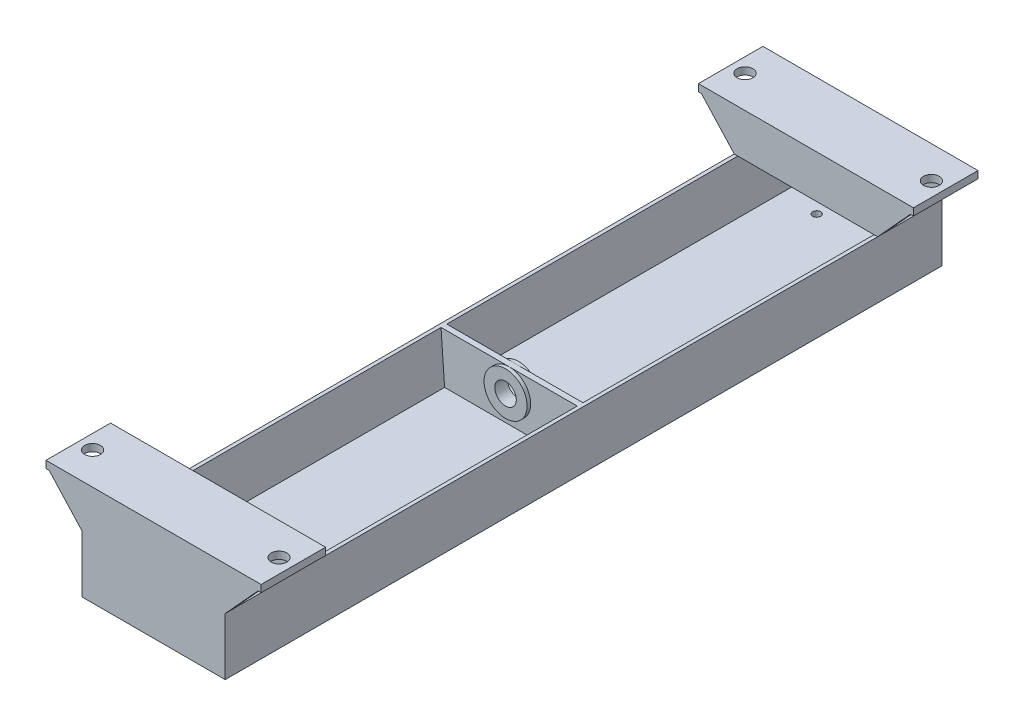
ISO-10303-21;
HEADER;
FILE_DESCRIPTION(('STEP AP214'),'2;1');
FILE_NAME('part.step','',(''),(''),'','','');
FILE_SCHEMA(('AUTOMOTIVE_DESIGN { 1 0 10303 214 1 1 1 1 }'));
ENDSEC;
DATA;
#1=APPLICATION_CONTEXT('core data for automotive mechanical design processes');
#2=APPLICATION_PROTOCOL_DEFINITION('international standard','automotive_design',2000,#1);
#3=PRODUCT_CONTEXT('',#1,'mechanical');
#4=PRODUCT('Part','Part','',(#3));
#5=PRODUCT_RELATED_PRODUCT_CATEGORY('part','',(#4));
#6=PRODUCT_DEFINITION_FORMATION('','',#4);
#7=PRODUCT_DEFINITION_CONTEXT('part definition',#1,'design');
#8=PRODUCT_DEFINITION('design','',#6,#7);
#9=PRODUCT_DEFINITION_SHAPE('','',#8);
#10=(LENGTH_UNIT() NAMED_UNIT(*) SI_UNIT(.MILLI.,.METRE.));
#11=(NAMED_UNIT(*) PLANE_ANGLE_UNIT() SI_UNIT($,.RADIAN.));
#12=(NAMED_UNIT(*) SI_UNIT($,.STERADIAN.) SOLID_ANGLE_UNIT());
#13=UNCERTAINTY_MEASURE_WITH_UNIT(LENGTH_MEASURE(1.E-05),#10,'distance_accuracy_value','');
#14=(GEOMETRIC_REPRESENTATION_CONTEXT(3) GLOBAL_UNCERTAINTY_ASSIGNED_CONTEXT((#13)) GLOBAL_UNIT_ASSIGNED_CONTEXT((#10,
#11,#12)) REPRESENTATION_CONTEXT('',''));
#15=CARTESIAN_POINT('',(0.,0.,0.));
#16=DIRECTION('',(0.,0.,1.));
#17=DIRECTION('',(1.,0.,0.));
#18=AXIS2_PLACEMENT_3D('',#15,#16,#17);
#19=CARTESIAN_POINT('',(-95.25,88.8999999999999,311.15));
#20=DIRECTION('',(0.,1.,0.));
#21=DIRECTION('',(-1.,0.,0.));
#22=AXIS2_PLACEMENT_3D('',#19,#20,#21);
#23=PLANE('',#22);
#24=CARTESIAN_POINT('',(82.55,88.8999999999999,288.925));
#25=DIRECTION('',(0.,1.,0.));
#26=DIRECTION('',(1.,0.,0.));
#27=AXIS2_PLACEMENT_3D('',#24,#25,#26);
#28=CIRCLE('',#27,6.98499999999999);
#29=CARTESIAN_POINT('',(89.535,88.8999999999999,288.925));
#30=VERTEX_POINT('',#29);
#31=EDGE_CURVE('E615',#30,#30,#28,.T.);
#32=ORIENTED_EDGE('',*,*,#31,.F.);
#33=EDGE_LOOP('',(#32));
#34=FACE_BOUND('',#33,.T.);
#35=DIRECTION('',(-1.,0.,0.));
#36=VECTOR('',#35,1.);
#37=CARTESIAN_POINT('',(-95.25,88.8999999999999,260.35));
#38=LINE('',#37,#36);
#39=CARTESIAN_POINT('',(95.25,88.8999999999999,260.35));
#40=VERTEX_POINT('',#39);
#41=CARTESIAN_POINT('',(-95.25,88.8999999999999,260.35));
#42=VERTEX_POINT('',#41);
#43=EDGE_CURVE('E286',#40,#42,#38,.T.);
#44=ORIENTED_EDGE('',*,*,#43,.T.);
#45=DIRECTION('',(0.,0.,1.));
#46=VECTOR('',#45,1.);
#47=CARTESIAN_POINT('',(-95.25,88.8999999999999,311.15));
#48=LINE('',#47,#46);
#49=CARTESIAN_POINT('',(-95.25,88.8999999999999,317.5));
#50=VERTEX_POINT('',#49);
#51=EDGE_CURVE('E478',#42,#50,#48,.T.);
#52=ORIENTED_EDGE('',*,*,#51,.T.);
#53=DIRECTION('',(-1.,0.,0.));
#54=VECTOR('',#53,1.);
#55=CARTESIAN_POINT('',(-95.25,88.8999999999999,317.5));
#56=LINE('',#55,#54);
#57=CARTESIAN_POINT('',(95.25,88.8999999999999,317.5));
#58=VERTEX_POINT('',#57);
#59=EDGE_CURVE('E464',#58,#50,#56,.T.);
#60=ORIENTED_EDGE('',*,*,#59,.F.);
#61=DIRECTION('',(0.,0.,1.));
#62=VECTOR('',#61,1.);
#63=CARTESIAN_POINT('',(95.25,88.8999999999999,311.15));
#64=LINE('',#63,#62);
#65=EDGE_CURVE('E477',#40,#58,#64,.T.);
#66=ORIENTED_EDGE('',*,*,#65,.F.);
#67=EDGE_LOOP('',(#44,#52,#60,#66));
#68=FACE_BOUND('',#67,.T.);
#69=CARTESIAN_POINT('',(-82.55,88.8999999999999,288.925));
#70=DIRECTION('',(0.,-1.,0.));
#71=DIRECTION('',(-1.,0.,0.));
#72=AXIS2_PLACEMENT_3D('',#69,#70,#71);
#73=CIRCLE('',#72,6.98499999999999);
#74=CARTESIAN_POINT('',(-89.535,88.8999999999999,288.925));
#75=VERTEX_POINT('',#74);
#76=EDGE_CURVE('E606',#75,#75,#73,.T.);
#77=ORIENTED_EDGE('',*,*,#76,.T.);
#78=EDGE_LOOP('',(#77));
#79=FACE_BOUND('',#78,.T.);
#80=ADVANCED_FACE('F26',(#34,#68,#79),#23,.T.);
#81=CARTESIAN_POINT('',(95.25,82.55,317.5));
#82=DIRECTION('',(0.,1.,0.));
#83=DIRECTION('',(-1.,0.,0.));
#84=AXIS2_PLACEMENT_3D('',#81,#82,#83);
#85=PLANE('',#84);
#86=CARTESIAN_POINT('',(82.55,82.55,288.925));
#87=DIRECTION('',(0.,1.,0.));
#88=DIRECTION('',(-1.,0.,0.));
#89=AXIS2_PLACEMENT_3D('',#86,#87,#88);
#90=CIRCLE('',#89,6.98499999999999);
#91=CARTESIAN_POINT('',(75.565,82.55,288.925));
#92=VERTEX_POINT('',#91);
#93=EDGE_CURVE('E30',#92,#92,#90,.T.);
#94=ORIENTED_EDGE('',*,*,#93,.T.);
#95=EDGE_LOOP('',(#94));
#96=FACE_BOUND('',#95,.T.);
#97=DIRECTION('',(0.,0.,-1.));
#98=VECTOR('',#97,1.);
#99=CARTESIAN_POINT('',(-92.4997680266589,82.5499999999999,311.15));
#100=LINE('',#99,#98);
#101=CARTESIAN_POINT('',(-92.4997680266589,82.55,317.5));
#102=VERTEX_POINT('',#101);
#103=CARTESIAN_POINT('',(-92.4997680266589,82.55,311.15));
#104=VERTEX_POINT('',#103);
#105=EDGE_CURVE('E44',#102,#104,#100,.T.);
#106=ORIENTED_EDGE('',*,*,#105,.F.);
#107=DIRECTION('',(-1.,0.,0.));
#108=VECTOR('',#107,1.);
#109=CARTESIAN_POINT('',(95.25,82.55,317.5));
#110=LINE('',#109,#108);
#111=CARTESIAN_POINT('',(-95.25,82.5499999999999,317.5));
#112=VERTEX_POINT('',#111);
#113=EDGE_CURVE('E318',#102,#112,#110,.T.);
#114=ORIENTED_EDGE('',*,*,#113,.T.);
#115=DIRECTION('',(0.,0.,-1.));
#116=VECTOR('',#115,1.);
#117=CARTESIAN_POINT('',(-95.25,82.5499999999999,260.35));
#118=LINE('',#117,#116);
#119=CARTESIAN_POINT('',(-95.25,82.5499999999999,260.35));
#120=VERTEX_POINT('',#119);
#121=EDGE_CURVE('E315',#112,#120,#118,.T.);
#122=ORIENTED_EDGE('',*,*,#121,.T.);
#123=DIRECTION('',(1.,0.,0.));
#124=VECTOR('',#123,1.);
#125=CARTESIAN_POINT('',(95.25,82.55,260.35));
#126=LINE('',#125,#124);
#127=CARTESIAN_POINT('',(-92.4997680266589,82.55,260.35));
#128=VERTEX_POINT('',#127);
#129=EDGE_CURVE('E300',#120,#128,#126,.T.);
#130=ORIENTED_EDGE('',*,*,#129,.T.);
#131=DIRECTION('',(0.,0.,-1.));
#132=VECTOR('',#131,1.);
#133=CARTESIAN_POINT('',(-92.4997680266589,82.5499999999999,260.35));
#134=LINE('',#133,#132);
#135=CARTESIAN_POINT('',(-92.4997680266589,82.55,266.7));
#136=VERTEX_POINT('',#135);
#137=EDGE_CURVE('E324',#136,#128,#134,.T.);
#138=ORIENTED_EDGE('',*,*,#137,.F.);
#139=DIRECTION('',(-1.,0.,0.));
#140=VECTOR('',#139,1.);
#141=CARTESIAN_POINT('',(-95.25,82.5499999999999,266.7));
#142=LINE('',#141,#140);
#143=CARTESIAN_POINT('',(92.4997680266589,82.55,266.7));
#144=VERTEX_POINT('',#143);
#145=EDGE_CURVE('E322',#144,#136,#142,.T.);
#146=ORIENTED_EDGE('',*,*,#145,.F.);
#147=DIRECTION('',(0.,0.,1.));
#148=VECTOR('',#147,1.);
#149=CARTESIAN_POINT('',(92.4997680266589,82.55,260.35));
#150=LINE('',#149,#148);
#151=CARTESIAN_POINT('',(92.4997680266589,82.55,260.35));
#152=VERTEX_POINT('',#151);
#153=EDGE_CURVE('E299',#152,#144,#150,.T.);
#154=ORIENTED_EDGE('',*,*,#153,.F.);
#155=CARTESIAN_POINT('',(95.25,82.55,260.35));
#156=VERTEX_POINT('',#155);
#157=EDGE_CURVE('E283',#152,#156,#126,.T.);
#158=ORIENTED_EDGE('',*,*,#157,.T.);
#159=DIRECTION('',(0.,0.,1.));
#160=VECTOR('',#159,1.);
#161=CARTESIAN_POINT('',(95.25,82.55,260.35));
#162=LINE('',#161,#160);
#163=CARTESIAN_POINT('',(95.25,82.55,317.5));
#164=VERTEX_POINT('',#163);
#165=EDGE_CURVE('E297',#156,#164,#162,.T.);
#166=ORIENTED_EDGE('',*,*,#165,.T.);
#167=CARTESIAN_POINT('',(92.4997680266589,82.55,317.5));
#168=VERTEX_POINT('',#167);
#169=EDGE_CURVE('E319',#164,#168,#110,.T.);
#170=ORIENTED_EDGE('',*,*,#169,.T.);
#171=DIRECTION('',(0.,0.,1.));
#172=VECTOR('',#171,1.);
#173=CARTESIAN_POINT('',(92.4997680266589,82.55,311.15));
#174=LINE('',#173,#172);
#175=CARTESIAN_POINT('',(92.4997680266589,82.55,311.15));
#176=VERTEX_POINT('',#175);
#177=EDGE_CURVE('E326',#176,#168,#174,.T.);
#178=ORIENTED_EDGE('',*,*,#177,.F.);
#179=DIRECTION('',(1.,0.,0.));
#180=VECTOR('',#179,1.);
#181=CARTESIAN_POINT('',(-60.325,82.55,311.15));
#182=LINE('',#181,#180);
#183=EDGE_CURVE('E328',#104,#176,#182,.T.);
#184=ORIENTED_EDGE('',*,*,#183,.F.);
#185=EDGE_LOOP('',(#106,#114,#122,#130,#138,#146,#154,#158,#166,#170,#178,#184));
#186=FACE_BOUND('',#185,.T.);
#187=CARTESIAN_POINT('',(-82.55,82.5499999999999,288.925));
#188=DIRECTION('',(0.,1.,0.));
#189=DIRECTION('',(-1.,0.,0.));
#190=AXIS2_PLACEMENT_3D('',#187,#188,#189);
#191=CIRCLE('',#190,6.98499999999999);
#192=CARTESIAN_POINT('',(-89.535,82.5499999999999,288.925));
#193=VERTEX_POINT('',#192);
#194=EDGE_CURVE('E604',#193,#193,#191,.F.);
#195=ORIENTED_EDGE('',*,*,#194,.F.);
#196=EDGE_LOOP('',(#195));
#197=FACE_BOUND('',#196,.T.);
#198=ADVANCED_FACE('F294',(#96,#186,#197),#85,.F.);
#199=CARTESIAN_POINT('',(-95.25,88.8999999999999,-311.15));
#200=DIRECTION('',(0.,-1.,0.));
#201=DIRECTION('',(1.,0.,0.));
#202=AXIS2_PLACEMENT_3D('',#199,#200,#201);
#203=PLANE('',#202);
#204=DIRECTION('',(0.,0.,-1.));
#205=VECTOR('',#204,1.);
#206=CARTESIAN_POINT('',(-95.25,88.8999999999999,-311.15));
#207=LINE('',#206,#205);
#208=CARTESIAN_POINT('',(-95.25,88.8999999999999,-260.35));
#209=VERTEX_POINT('',#208);
#210=CARTESIAN_POINT('',(-95.25,88.8999999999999,-317.5));
#211=VERTEX_POINT('',#210);
#212=EDGE_CURVE('E426',#209,#211,#207,.T.);
#213=ORIENTED_EDGE('',*,*,#212,.F.);
#214=DIRECTION('',(-1.,0.,0.));
#215=VECTOR('',#214,1.);
#216=CARTESIAN_POINT('',(-95.25,88.8999999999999,-260.35));
#217=LINE('',#216,#215);
#218=CARTESIAN_POINT('',(95.25,88.8999999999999,-260.35));
#219=VERTEX_POINT('',#218);
#220=EDGE_CURVE('E378',#219,#209,#217,.T.);
#221=ORIENTED_EDGE('',*,*,#220,.F.);
#222=DIRECTION('',(0.,0.,-1.));
#223=VECTOR('',#222,1.);
#224=CARTESIAN_POINT('',(95.25,88.8999999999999,-311.15));
#225=LINE('',#224,#223);
#226=CARTESIAN_POINT('',(95.25,88.8999999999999,-317.5));
#227=VERTEX_POINT('',#226);
#228=EDGE_CURVE('E423',#219,#227,#225,.T.);
#229=ORIENTED_EDGE('',*,*,#228,.T.);
#230=DIRECTION('',(-1.,0.,0.));
#231=VECTOR('',#230,1.);
#232=CARTESIAN_POINT('',(-95.25,88.8999999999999,-317.5));
#233=LINE('',#232,#231);
#234=EDGE_CURVE('E402',#227,#211,#233,.T.);
#235=ORIENTED_EDGE('',*,*,#234,.T.);
#236=EDGE_LOOP('',(#213,#221,#229,#235));
#237=FACE_BOUND('',#236,.T.);
#238=CARTESIAN_POINT('',(-82.55,88.8999999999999,-288.925));
#239=DIRECTION('',(0.,1.,0.));
#240=DIRECTION('',(-1.,0.,0.));
#241=AXIS2_PLACEMENT_3D('',#238,#239,#240);
#242=CIRCLE('',#241,6.98499999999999);
#243=CARTESIAN_POINT('',(-89.535,88.8999999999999,-288.925));
#244=VERTEX_POINT('',#243);
#245=EDGE_CURVE('E309',#244,#244,#242,.T.);
#246=ORIENTED_EDGE('',*,*,#245,.F.);
#247=EDGE_LOOP('',(#246));
#248=FACE_BOUND('',#247,.T.);
#249=CARTESIAN_POINT('',(82.55,88.8999999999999,-288.925));
#250=DIRECTION('',(0.,-1.,0.));
#251=DIRECTION('',(1.,0.,0.));
#252=AXIS2_PLACEMENT_3D('',#249,#250,#251);
#253=CIRCLE('',#252,6.98499999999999);
#254=CARTESIAN_POINT('',(89.535,88.8999999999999,-288.925));
#255=VERTEX_POINT('',#254);
#256=EDGE_CURVE('E603',#255,#255,#253,.T.);
#257=ORIENTED_EDGE('',*,*,#256,.T.);
#258=EDGE_LOOP('',(#257));
#259=FACE_BOUND('',#258,.T.);
#260=ADVANCED_FACE('F694',(#237,#248,#259),#203,.F.);
#261=CARTESIAN_POINT('',(95.25,82.55,-317.5));
#262=DIRECTION('',(0.,1.,0.));
#263=DIRECTION('',(-1.,0.,0.));
#264=AXIS2_PLACEMENT_3D('',#261,#262,#263);
#265=PLANE('',#264);
#266=DIRECTION('',(-1.,0.,0.));
#267=VECTOR('',#266,1.);
#268=CARTESIAN_POINT('',(-60.325,82.55,-311.15));
#269=LINE('',#268,#267);
#270=CARTESIAN_POINT('',(92.4997680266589,82.55,-311.15));
#271=VERTEX_POINT('',#270);
#272=CARTESIAN_POINT('',(-92.4997680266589,82.5499999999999,-311.15));
#273=VERTEX_POINT('',#272);
#274=EDGE_CURVE('E354',#271,#273,#269,.T.);
#275=ORIENTED_EDGE('',*,*,#274,.F.);
#276=DIRECTION('',(0.,0.,-1.));
#277=VECTOR('',#276,1.);
#278=CARTESIAN_POINT('',(92.4997680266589,82.55,-311.15));
#279=LINE('',#278,#277);
#280=CARTESIAN_POINT('',(92.4997680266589,82.55,-317.5));
#281=VERTEX_POINT('',#280);
#282=EDGE_CURVE('E357',#271,#281,#279,.T.);
#283=ORIENTED_EDGE('',*,*,#282,.T.);
#284=DIRECTION('',(-1.,0.,0.));
#285=VECTOR('',#284,1.);
#286=CARTESIAN_POINT('',(95.25,82.55,-317.5));
#287=LINE('',#286,#285);
#288=CARTESIAN_POINT('',(95.25,82.55,-317.5));
#289=VERTEX_POINT('',#288);
#290=EDGE_CURVE('E335',#289,#281,#287,.T.);
#291=ORIENTED_EDGE('',*,*,#290,.F.);
#292=DIRECTION('',(0.,0.,-1.));
#293=VECTOR('',#292,1.);
#294=CARTESIAN_POINT('',(95.25,82.55,-260.35));
#295=LINE('',#294,#293);
#296=CARTESIAN_POINT('',(95.25,82.55,-260.35));
#297=VERTEX_POINT('',#296);
#298=EDGE_CURVE('E331',#297,#289,#295,.T.);
#299=ORIENTED_EDGE('',*,*,#298,.F.);
#300=DIRECTION('',(1.,0.,0.));
#301=VECTOR('',#300,1.);
#302=CARTESIAN_POINT('',(95.25,82.55,-260.35));
#303=LINE('',#302,#301);
#304=CARTESIAN_POINT('',(92.4997680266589,82.55,-260.35));
#305=VERTEX_POINT('',#304);
#306=EDGE_CURVE('E341',#305,#297,#303,.T.);
#307=ORIENTED_EDGE('',*,*,#306,.F.);
#308=DIRECTION('',(0.,0.,-1.));
#309=VECTOR('',#308,1.);
#310=CARTESIAN_POINT('',(92.4997680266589,82.55,-260.35));
#311=LINE('',#310,#309);
#312=CARTESIAN_POINT('',(92.4997680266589,82.55,-266.7));
#313=VERTEX_POINT('',#312);
#314=EDGE_CURVE('E350',#305,#313,#311,.T.);
#315=ORIENTED_EDGE('',*,*,#314,.T.);
#316=DIRECTION('',(1.,0.,0.));
#317=VECTOR('',#316,1.);
#318=CARTESIAN_POINT('',(-95.25,82.5499999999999,-266.7));
#319=LINE('',#318,#317);
#320=CARTESIAN_POINT('',(-92.4997680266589,82.5499999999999,-266.7));
#321=VERTEX_POINT('',#320);
#322=EDGE_CURVE('E347',#321,#313,#319,.T.);
#323=ORIENTED_EDGE('',*,*,#322,.F.);
#324=DIRECTION('',(0.,0.,1.));
#325=VECTOR('',#324,1.);
#326=CARTESIAN_POINT('',(-92.4997680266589,82.5499999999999,-260.35));
#327=LINE('',#326,#325);
#328=CARTESIAN_POINT('',(-92.4997680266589,82.5499999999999,-260.35));
#329=VERTEX_POINT('',#328);
#330=EDGE_CURVE('E345',#321,#329,#327,.T.);
#331=ORIENTED_EDGE('',*,*,#330,.T.);
#332=CARTESIAN_POINT('',(-95.25,82.5499999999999,-260.35));
#333=VERTEX_POINT('',#332);
#334=EDGE_CURVE('E342',#333,#329,#303,.T.);
#335=ORIENTED_EDGE('',*,*,#334,.F.);
#336=DIRECTION('',(0.,0.,1.));
#337=VECTOR('',#336,1.);
#338=CARTESIAN_POINT('',(-95.25,82.5499999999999,-260.35));
#339=LINE('',#338,#337);
#340=CARTESIAN_POINT('',(-95.25,82.5499999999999,-317.5));
#341=VERTEX_POINT('',#340);
#342=EDGE_CURVE('E338',#341,#333,#339,.T.);
#343=ORIENTED_EDGE('',*,*,#342,.F.);
#344=CARTESIAN_POINT('',(-92.4997680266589,82.5499999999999,-317.5));
#345=VERTEX_POINT('',#344);
#346=EDGE_CURVE('E334',#345,#341,#287,.T.);
#347=ORIENTED_EDGE('',*,*,#346,.F.);
#348=DIRECTION('',(0.,0.,1.));
#349=VECTOR('',#348,1.);
#350=CARTESIAN_POINT('',(-92.4997680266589,82.5499999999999,-311.15));
#351=LINE('',#350,#349);
#352=EDGE_CURVE('E352',#345,#273,#351,.T.);
#353=ORIENTED_EDGE('',*,*,#352,.T.);
#354=EDGE_LOOP('',(#275,#283,#291,#299,#307,#315,#323,#331,#335,#343,#347,#353));
#355=FACE_BOUND('',#354,.T.);
#356=CARTESIAN_POINT('',(-82.55,82.5499999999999,-288.925));
#357=DIRECTION('',(0.,1.,0.));
#358=DIRECTION('',(-1.,0.,0.));
#359=AXIS2_PLACEMENT_3D('',#356,#357,#358);
#360=CIRCLE('',#359,6.98499999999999);
#361=CARTESIAN_POINT('',(-89.535,82.5499999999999,-288.925));
#362=VERTEX_POINT('',#361);
#363=EDGE_CURVE('E306',#362,#362,#360,.T.);
#364=ORIENTED_EDGE('',*,*,#363,.T.);
#365=EDGE_LOOP('',(#364));
#366=FACE_BOUND('',#365,.T.);
#367=CARTESIAN_POINT('',(82.55,82.55,-288.925));
#368=DIRECTION('',(0.,1.,0.));
#369=DIRECTION('',(-1.,0.,0.));
#370=AXIS2_PLACEMENT_3D('',#367,#368,#369);
#371=CIRCLE('',#370,6.98499999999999);
#372=CARTESIAN_POINT('',(75.565,82.55,-288.925));
#373=VERTEX_POINT('',#372);
#374=EDGE_CURVE('E601',#373,#373,#371,.F.);
#375=ORIENTED_EDGE('',*,*,#374,.F.);
#376=EDGE_LOOP('',(#375));
#377=FACE_BOUND('',#376,.T.);
#378=ADVANCED_FACE('F683',(#355,#366,#377),#265,.F.);
#379=CARTESIAN_POINT('',(-60.325,50.8,311.15));
#380=DIRECTION('',(0.,0.,-1.));
#381=DIRECTION('',(1.,0.,0.));
#382=AXIS2_PLACEMENT_3D('',#379,#380,#381);
#383=PLANE('',#382);
#384=DIRECTION('',(0.674404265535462,-0.738362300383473,0.));
#385=VECTOR('',#384,1.);
#386=CARTESIAN_POINT('',(-63.5,50.8,311.15));
#387=LINE('',#386,#385);
#388=CARTESIAN_POINT('',(-63.5,50.8,311.15));
#389=VERTEX_POINT('',#388);
#390=EDGE_CURVE('E475',#104,#389,#387,.T.);
#391=ORIENTED_EDGE('',*,*,#390,.F.);
#392=ORIENTED_EDGE('',*,*,#183,.T.);
#393=DIRECTION('',(0.674404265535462,0.738362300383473,0.));
#394=VECTOR('',#393,1.);
#395=CARTESIAN_POINT('',(95.25,85.5610539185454,311.15));
#396=LINE('',#395,#394);
#397=CARTESIAN_POINT('',(63.5,50.8,311.15));
#398=VERTEX_POINT('',#397);
#399=EDGE_CURVE('E472',#398,#176,#396,.T.);
#400=ORIENTED_EDGE('',*,*,#399,.F.);
#401=DIRECTION('',(1.,0.,0.));
#402=VECTOR('',#401,1.);
#403=CARTESIAN_POINT('',(-63.5,50.8,311.15));
#404=LINE('',#403,#402);
#405=CARTESIAN_POINT('',(60.325,50.8,311.15));
#406=VERTEX_POINT('',#405);
#407=EDGE_CURVE('E469',#406,#398,#404,.T.);
#408=ORIENTED_EDGE('',*,*,#407,.F.);
#409=DIRECTION('',(-0.0712470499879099,-0.997458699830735,0.));
#410=VECTOR('',#409,1.);
#411=CARTESIAN_POINT('',(57.15,6.35000000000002,311.15));
#412=LINE('',#411,#410);
#413=CARTESIAN_POINT('',(57.15,6.35000000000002,311.15));
#414=VERTEX_POINT('',#413);
#415=EDGE_CURVE('E487',#406,#414,#412,.T.);
#416=ORIENTED_EDGE('',*,*,#415,.T.);
#417=DIRECTION('',(-1.,0.,0.));
#418=VECTOR('',#417,1.);
#419=CARTESIAN_POINT('',(-57.15,6.35,311.15));
#420=LINE('',#419,#418);
#421=CARTESIAN_POINT('',(-57.15,6.35,311.15));
#422=VERTEX_POINT('',#421);
#423=EDGE_CURVE('E485',#414,#422,#420,.T.);
#424=ORIENTED_EDGE('',*,*,#423,.T.);
#425=DIRECTION('',(-0.0712470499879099,0.997458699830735,0.));
#426=VECTOR('',#425,1.);
#427=CARTESIAN_POINT('',(-60.325,50.8,311.15));
#428=LINE('',#427,#426);
#429=CARTESIAN_POINT('',(-60.325,50.8,311.15));
#430=VERTEX_POINT('',#429);
#431=EDGE_CURVE('E481',#422,#430,#428,.T.);
#432=ORIENTED_EDGE('',*,*,#431,.T.);
#433=EDGE_CURVE('E470',#389,#430,#404,.T.);
#434=ORIENTED_EDGE('',*,*,#433,.F.);
#435=EDGE_LOOP('',(#391,#392,#400,#408,#416,#424,#432,#434));
#436=FACE_BOUND('',#435,.T.);
#437=ADVANCED_FACE('F646',(#436),#383,.T.);
#438=CARTESIAN_POINT('',(-95.25,50.8,266.7));
#439=DIRECTION('',(0.,0.,1.));
#440=DIRECTION('',(1.,0.,0.));
#441=AXIS2_PLACEMENT_3D('',#438,#439,#440);
#442=PLANE('',#441);
#443=DIRECTION('',(0.674404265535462,0.738362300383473,0.));
#444=VECTOR('',#443,1.);
#445=CARTESIAN_POINT('',(95.25,85.5610539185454,266.7));
#446=LINE('',#445,#444);
#447=CARTESIAN_POINT('',(63.5,50.8,266.7));
#448=VERTEX_POINT('',#447);
#449=EDGE_CURVE('E434',#448,#144,#446,.T.);
#450=ORIENTED_EDGE('',*,*,#449,.T.);
#451=ORIENTED_EDGE('',*,*,#145,.T.);
#452=DIRECTION('',(0.674404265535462,-0.738362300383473,0.));
#453=VECTOR('',#452,1.);
#454=CARTESIAN_POINT('',(-63.5,50.8,266.7));
#455=LINE('',#454,#453);
#456=CARTESIAN_POINT('',(-63.5,50.8,266.7));
#457=VERTEX_POINT('',#456);
#458=EDGE_CURVE('E438',#136,#457,#455,.T.);
#459=ORIENTED_EDGE('',*,*,#458,.T.);
#460=DIRECTION('',(1.,0.,0.));
#461=VECTOR('',#460,1.);
#462=CARTESIAN_POINT('',(-63.5,50.8,266.7));
#463=LINE('',#462,#461);
#464=CARTESIAN_POINT('',(-60.325,50.8,266.7));
#465=VERTEX_POINT('',#464);
#466=EDGE_CURVE('E431',#457,#465,#463,.T.);
#467=ORIENTED_EDGE('',*,*,#466,.T.);
#468=CARTESIAN_POINT('',(60.325,50.8,266.7));
#469=VERTEX_POINT('',#468);
#470=EDGE_CURVE('E435',#465,#469,#463,.T.);
#471=ORIENTED_EDGE('',*,*,#470,.T.);
#472=EDGE_CURVE('E422',#469,#448,#463,.T.);
#473=ORIENTED_EDGE('',*,*,#472,.T.);
#474=EDGE_LOOP('',(#450,#451,#459,#467,#471,#473));
#475=FACE_BOUND('',#474,.T.);
#476=ADVANCED_FACE('F757',(#475),#442,.T.);
#477=CARTESIAN_POINT('',(-63.5,50.8,311.15));
#478=DIRECTION('',(-0.738362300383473,-0.674404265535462,0.));
#479=DIRECTION('',(0.674404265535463,-0.738362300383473,0.));
#480=AXIS2_PLACEMENT_3D('',#477,#478,#479);
#481=PLANE('',#480);
#482=DIRECTION('',(0.674404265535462,-0.738362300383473,0.));
#483=VECTOR('',#482,1.);
#484=CARTESIAN_POINT('',(-63.5,50.8,317.5));
#485=LINE('',#484,#483);
#486=CARTESIAN_POINT('',(-63.5,50.8,317.5));
#487=VERTEX_POINT('',#486);
#488=EDGE_CURVE('E49',#102,#487,#485,.T.);
#489=ORIENTED_EDGE('',*,*,#488,.F.);
#490=ORIENTED_EDGE('',*,*,#105,.T.);
#491=ORIENTED_EDGE('',*,*,#390,.T.);
#492=DIRECTION('',(0.,0.,-1.));
#493=VECTOR('',#492,1.);
#494=CARTESIAN_POINT('',(-63.5,50.8,317.5));
#495=LINE('',#494,#493);
#496=EDGE_CURVE('E11',#487,#389,#495,.T.);
#497=ORIENTED_EDGE('',*,*,#496,.F.);
#498=EDGE_LOOP('',(#489,#490,#491,#497));
#499=FACE_BOUND('',#498,.T.);
#500=ADVANCED_FACE('F747',(#499),#481,.T.);
#501=CARTESIAN_POINT('',(95.25,85.5610539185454,311.15));
#502=DIRECTION('',(0.738362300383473,-0.674404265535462,0.));
#503=DIRECTION('',(0.674404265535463,0.738362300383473,0.));
#504=AXIS2_PLACEMENT_3D('',#501,#502,#503);
#505=PLANE('',#504);
#506=ORIENTED_EDGE('',*,*,#399,.T.);
#507=ORIENTED_EDGE('',*,*,#177,.T.);
#508=DIRECTION('',(0.674404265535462,0.738362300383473,0.));
#509=VECTOR('',#508,1.);
#510=CARTESIAN_POINT('',(95.25,85.5610539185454,317.5));
#511=LINE('',#510,#509);
#512=CARTESIAN_POINT('',(63.5,50.8,317.5));
#513=VERTEX_POINT('',#512);
#514=EDGE_CURVE('E460',#513,#168,#511,.T.);
#515=ORIENTED_EDGE('',*,*,#514,.F.);
#516=DIRECTION('',(0.,0.,-1.));
#517=VECTOR('',#516,1.);
#518=CARTESIAN_POINT('',(63.5,50.8,317.5));
#519=LINE('',#518,#517);
#520=EDGE_CURVE('E588',#513,#398,#519,.T.);
#521=ORIENTED_EDGE('',*,*,#520,.T.);
#522=EDGE_LOOP('',(#506,#507,#515,#521));
#523=FACE_BOUND('',#522,.T.);
#524=ADVANCED_FACE('F641',(#523),#505,.T.);
#525=CARTESIAN_POINT('',(-63.5,50.8,260.35));
#526=DIRECTION('',(-0.738362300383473,-0.674404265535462,0.));
#527=DIRECTION('',(0.674404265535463,-0.738362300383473,0.));
#528=AXIS2_PLACEMENT_3D('',#525,#526,#527);
#529=PLANE('',#528);
#530=ORIENTED_EDGE('',*,*,#458,.F.);
#531=ORIENTED_EDGE('',*,*,#137,.T.);
#532=DIRECTION('',(0.674404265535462,-0.738362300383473,0.));
#533=VECTOR('',#532,1.);
#534=CARTESIAN_POINT('',(-63.5,50.8,260.35));
#535=LINE('',#534,#533);
#536=CARTESIAN_POINT('',(-63.5,50.8,260.35));
#537=VERTEX_POINT('',#536);
#538=EDGE_CURVE('E449',#128,#537,#535,.T.);
#539=ORIENTED_EDGE('',*,*,#538,.T.);
#540=DIRECTION('',(0.,0.,1.));
#541=VECTOR('',#540,1.);
#542=CARTESIAN_POINT('',(-63.5,50.8,260.35));
#543=LINE('',#542,#541);
#544=EDGE_CURVE('E452',#537,#457,#543,.T.);
#545=ORIENTED_EDGE('',*,*,#544,.T.);
#546=EDGE_LOOP('',(#530,#531,#539,#545));
#547=FACE_BOUND('',#546,.T.);
#548=ADVANCED_FACE('F760',(#547),#529,.T.);
#549=CARTESIAN_POINT('',(95.25,85.5610539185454,260.35));
#550=DIRECTION('',(0.738362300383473,-0.674404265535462,0.));
#551=DIRECTION('',(0.674404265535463,0.738362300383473,0.));
#552=AXIS2_PLACEMENT_3D('',#549,#550,#551);
#553=PLANE('',#552);
#554=DIRECTION('',(0.674404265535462,0.738362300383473,0.));
#555=VECTOR('',#554,1.);
#556=CARTESIAN_POINT('',(95.25,85.5610539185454,260.35));
#557=LINE('',#556,#555);
#558=CARTESIAN_POINT('',(63.5,50.8,260.35));
#559=VERTEX_POINT('',#558);
#560=EDGE_CURVE('E289',#559,#152,#557,.T.);
#561=ORIENTED_EDGE('',*,*,#560,.T.);
#562=ORIENTED_EDGE('',*,*,#153,.T.);
#563=ORIENTED_EDGE('',*,*,#449,.F.);
#564=DIRECTION('',(0.,0.,1.));
#565=VECTOR('',#564,1.);
#566=CARTESIAN_POINT('',(63.5,50.8,260.35));
#567=LINE('',#566,#565);
#568=EDGE_CURVE('E451',#559,#448,#567,.T.);
#569=ORIENTED_EDGE('',*,*,#568,.F.);
#570=EDGE_LOOP('',(#561,#562,#563,#569));
#571=FACE_BOUND('',#570,.T.);
#572=ADVANCED_FACE('F840',(#571),#553,.T.);
#573=CARTESIAN_POINT('',(-60.325,50.8,-311.15));
#574=DIRECTION('',(0.,0.,1.));
#575=DIRECTION('',(1.,0.,0.));
#576=AXIS2_PLACEMENT_3D('',#573,#574,#575);
#577=PLANE('',#576);
#578=DIRECTION('',(0.674404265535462,0.738362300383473,0.));
#579=VECTOR('',#578,1.);
#580=CARTESIAN_POINT('',(95.25,85.5610539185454,-311.15));
#581=LINE('',#580,#579);
#582=CARTESIAN_POINT('',(63.5,50.8,-311.15));
#583=VERTEX_POINT('',#582);
#584=EDGE_CURVE('E415',#583,#271,#581,.T.);
#585=ORIENTED_EDGE('',*,*,#584,.T.);
#586=ORIENTED_EDGE('',*,*,#274,.T.);
#587=DIRECTION('',(0.674404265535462,-0.738362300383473,0.));
#588=VECTOR('',#587,1.);
#589=CARTESIAN_POINT('',(-63.5,50.8,-311.15));
#590=LINE('',#589,#588);
#591=CARTESIAN_POINT('',(-63.5,50.8,-311.15));
#592=VERTEX_POINT('',#591);
#593=EDGE_CURVE('E413',#273,#592,#590,.T.);
#594=ORIENTED_EDGE('',*,*,#593,.T.);
#595=DIRECTION('',(1.,0.,0.));
#596=VECTOR('',#595,1.);
#597=CARTESIAN_POINT('',(-63.5,50.8,-311.15));
#598=LINE('',#597,#596);
#599=CARTESIAN_POINT('',(-60.325,50.8,-311.15));
#600=VERTEX_POINT('',#599);
#601=EDGE_CURVE('E410',#592,#600,#598,.T.);
#602=ORIENTED_EDGE('',*,*,#601,.T.);
#603=DIRECTION('',(-0.0712470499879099,0.997458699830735,0.));
#604=VECTOR('',#603,1.);
#605=CARTESIAN_POINT('',(-60.325,50.8,-311.15));
#606=LINE('',#605,#604);
#607=CARTESIAN_POINT('',(-57.15,6.35,-311.15));
#608=VERTEX_POINT('',#607);
#609=EDGE_CURVE('E493',#608,#600,#606,.T.);
#610=ORIENTED_EDGE('',*,*,#609,.F.);
#611=DIRECTION('',(-1.,0.,0.));
#612=VECTOR('',#611,1.);
#613=CARTESIAN_POINT('',(-57.15,6.35,-311.15));
#614=LINE('',#613,#612);
#615=CARTESIAN_POINT('',(57.15,6.35000000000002,-311.15));
#616=VERTEX_POINT('',#615);
#617=EDGE_CURVE('E491',#616,#608,#614,.T.);
#618=ORIENTED_EDGE('',*,*,#617,.F.);
#619=DIRECTION('',(-0.0712470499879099,-0.997458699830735,0.));
#620=VECTOR('',#619,1.);
#621=CARTESIAN_POINT('',(57.15,6.35000000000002,-311.15));
#622=LINE('',#621,#620);
#623=CARTESIAN_POINT('',(60.325,50.8,-311.15));
#624=VERTEX_POINT('',#623);
#625=EDGE_CURVE('E489',#624,#616,#622,.T.);
#626=ORIENTED_EDGE('',*,*,#625,.F.);
#627=EDGE_CURVE('E409',#624,#583,#598,.T.);
#628=ORIENTED_EDGE('',*,*,#627,.T.);
#629=EDGE_LOOP('',(#585,#586,#594,#602,#610,#618,#626,#628));
#630=FACE_BOUND('',#629,.T.);
#631=ADVANCED_FACE('F677',(#630),#577,.T.);
#632=CARTESIAN_POINT('',(-95.25,50.8,-266.7));
#633=DIRECTION('',(0.,0.,-1.));
#634=DIRECTION('',(1.,0.,0.));
#635=AXIS2_PLACEMENT_3D('',#632,#633,#634);
#636=PLANE('',#635);
#637=DIRECTION('',(0.674404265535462,-0.738362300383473,0.));
#638=VECTOR('',#637,1.);
#639=CARTESIAN_POINT('',(-63.5,50.8,-266.7));
#640=LINE('',#639,#638);
#641=CARTESIAN_POINT('',(-63.5,50.8,-266.7));
#642=VERTEX_POINT('',#641);
#643=EDGE_CURVE('E363',#321,#642,#640,.T.);
#644=ORIENTED_EDGE('',*,*,#643,.F.);
#645=ORIENTED_EDGE('',*,*,#322,.T.);
#646=DIRECTION('',(0.674404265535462,0.738362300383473,0.));
#647=VECTOR('',#646,1.);
#648=CARTESIAN_POINT('',(95.25,85.5610539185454,-266.7));
#649=LINE('',#648,#647);
#650=CARTESIAN_POINT('',(63.5,50.8,-266.7));
#651=VERTEX_POINT('',#650);
#652=EDGE_CURVE('E366',#651,#313,#649,.T.);
#653=ORIENTED_EDGE('',*,*,#652,.F.);
#654=DIRECTION('',(1.,0.,0.));
#655=VECTOR('',#654,1.);
#656=CARTESIAN_POINT('',(-63.5,50.8,-266.7));
#657=LINE('',#656,#655);
#658=CARTESIAN_POINT('',(60.325,50.8,-266.7));
#659=VERTEX_POINT('',#658);
#660=EDGE_CURVE('E359',#659,#651,#657,.T.);
#661=ORIENTED_EDGE('',*,*,#660,.F.);
#662=CARTESIAN_POINT('',(-60.325,50.8,-266.7));
#663=VERTEX_POINT('',#662);
#664=EDGE_CURVE('E364',#663,#659,#657,.T.);
#665=ORIENTED_EDGE('',*,*,#664,.F.);
#666=EDGE_CURVE('E360',#642,#663,#657,.T.);
#667=ORIENTED_EDGE('',*,*,#666,.F.);
#668=EDGE_LOOP('',(#644,#645,#653,#661,#665,#667));
#669=FACE_BOUND('',#668,.T.);
#670=ADVANCED_FACE('F794',(#669),#636,.T.);
#671=CARTESIAN_POINT('',(95.25,85.5610539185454,-311.15));
#672=DIRECTION('',(-0.738362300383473,0.674404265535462,0.));
#673=DIRECTION('',(-0.674404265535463,-0.738362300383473,0.));
#674=AXIS2_PLACEMENT_3D('',#671,#672,#673);
#675=PLANE('',#674);
#676=ORIENTED_EDGE('',*,*,#282,.F.);
#677=ORIENTED_EDGE('',*,*,#584,.F.);
#678=DIRECTION('',(0.,0.,-1.));
#679=VECTOR('',#678,1.);
#680=CARTESIAN_POINT('',(63.5,50.8,-311.15));
#681=LINE('',#680,#679);
#682=CARTESIAN_POINT('',(63.5,50.8,-317.5));
#683=VERTEX_POINT('',#682);
#684=EDGE_CURVE('E419',#583,#683,#681,.T.);
#685=ORIENTED_EDGE('',*,*,#684,.T.);
#686=DIRECTION('',(0.674404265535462,0.738362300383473,0.));
#687=VECTOR('',#686,1.);
#688=CARTESIAN_POINT('',(95.25,85.5610539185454,-317.5));
#689=LINE('',#688,#687);
#690=EDGE_CURVE('E406',#683,#281,#689,.T.);
#691=ORIENTED_EDGE('',*,*,#690,.T.);
#692=EDGE_LOOP('',(#676,#677,#685,#691));
#693=FACE_BOUND('',#692,.T.);
#694=ADVANCED_FACE('F680',(#693),#675,.F.);
#695=CARTESIAN_POINT('',(-63.5,50.8,-311.15));
#696=DIRECTION('',(0.738362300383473,0.674404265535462,0.));
#697=DIRECTION('',(-0.674404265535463,0.738362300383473,0.));
#698=AXIS2_PLACEMENT_3D('',#695,#696,#697);
#699=PLANE('',#698);
#700=ORIENTED_EDGE('',*,*,#352,.F.);
#701=DIRECTION('',(0.674404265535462,-0.738362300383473,0.));
#702=VECTOR('',#701,1.);
#703=CARTESIAN_POINT('',(-63.5,50.8,-317.5));
#704=LINE('',#703,#702);
#705=CARTESIAN_POINT('',(-63.5,50.8,-317.5));
#706=VERTEX_POINT('',#705);
#707=EDGE_CURVE('E398',#345,#706,#704,.T.);
#708=ORIENTED_EDGE('',*,*,#707,.T.);
#709=DIRECTION('',(0.,0.,-1.));
#710=VECTOR('',#709,1.);
#711=CARTESIAN_POINT('',(-63.5,50.8,-311.15));
#712=LINE('',#711,#710);
#713=EDGE_CURVE('E418',#592,#706,#712,.T.);
#714=ORIENTED_EDGE('',*,*,#713,.F.);
#715=ORIENTED_EDGE('',*,*,#593,.F.);
#716=EDGE_LOOP('',(#700,#708,#714,#715));
#717=FACE_BOUND('',#716,.T.);
#718=ADVANCED_FACE('F737',(#717),#699,.F.);
#719=CARTESIAN_POINT('',(95.25,85.5610539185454,-260.35));
#720=DIRECTION('',(-0.738362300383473,0.674404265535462,0.));
#721=DIRECTION('',(-0.674404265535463,-0.738362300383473,0.));
#722=AXIS2_PLACEMENT_3D('',#719,#720,#721);
#723=PLANE('',#722);
#724=ORIENTED_EDGE('',*,*,#314,.F.);
#725=DIRECTION('',(0.674404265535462,0.738362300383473,0.));
#726=VECTOR('',#725,1.);
#727=CARTESIAN_POINT('',(95.25,85.5610539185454,-260.35));
#728=LINE('',#727,#726);
#729=CARTESIAN_POINT('',(63.5,50.8,-260.35));
#730=VERTEX_POINT('',#729);
#731=EDGE_CURVE('E384',#730,#305,#728,.T.);
#732=ORIENTED_EDGE('',*,*,#731,.F.);
#733=DIRECTION('',(0.,0.,-1.));
#734=VECTOR('',#733,1.);
#735=CARTESIAN_POINT('',(63.5,50.8,-260.35));
#736=LINE('',#735,#734);
#737=EDGE_CURVE('E388',#730,#651,#736,.T.);
#738=ORIENTED_EDGE('',*,*,#737,.T.);
#739=ORIENTED_EDGE('',*,*,#652,.T.);
#740=EDGE_LOOP('',(#724,#732,#738,#739));
#741=FACE_BOUND('',#740,.T.);
#742=ADVANCED_FACE('F812',(#741),#723,.F.);
#743=CARTESIAN_POINT('',(-63.5,50.8,-260.35));
#744=DIRECTION('',(0.738362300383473,0.674404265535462,0.));
#745=DIRECTION('',(-0.674404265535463,0.738362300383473,0.));
#746=AXIS2_PLACEMENT_3D('',#743,#744,#745);
#747=PLANE('',#746);
#748=ORIENTED_EDGE('',*,*,#330,.F.);
#749=ORIENTED_EDGE('',*,*,#643,.T.);
#750=DIRECTION('',(0.,0.,-1.));
#751=VECTOR('',#750,1.);
#752=CARTESIAN_POINT('',(-63.5,50.8,-260.35));
#753=LINE('',#752,#751);
#754=CARTESIAN_POINT('',(-63.5,50.8,-260.35));
#755=VERTEX_POINT('',#754);
#756=EDGE_CURVE('E387',#755,#642,#753,.T.);
#757=ORIENTED_EDGE('',*,*,#756,.F.);
#758=DIRECTION('',(0.674404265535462,-0.738362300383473,0.));
#759=VECTOR('',#758,1.);
#760=CARTESIAN_POINT('',(-63.5,50.8,-260.35));
#761=LINE('',#760,#759);
#762=EDGE_CURVE('E373',#329,#755,#761,.T.);
#763=ORIENTED_EDGE('',*,*,#762,.F.);
#764=EDGE_LOOP('',(#748,#749,#757,#763));
#765=FACE_BOUND('',#764,.T.);
#766=ADVANCED_FACE('F709',(#765),#747,.F.);
#767=CARTESIAN_POINT('',(63.5,50.8,317.5));
#768=DIRECTION('',(0.,-1.,0.));
#769=DIRECTION('',(1.,0.,0.));
#770=AXIS2_PLACEMENT_3D('',#767,#768,#769);
#771=PLANE('',#770);
#772=DIRECTION('',(1.,0.,0.));
#773=VECTOR('',#772,1.);
#774=CARTESIAN_POINT('',(-63.5,50.8,-260.35));
#775=LINE('',#774,#773);
#776=CARTESIAN_POINT('',(-60.325,50.8,-260.35));
#777=VERTEX_POINT('',#776);
#778=EDGE_CURVE('E370',#755,#777,#775,.T.);
#779=ORIENTED_EDGE('',*,*,#778,.F.);
#780=EDGE_CURVE('E719',#537,#755,#495,.T.);
#781=ORIENTED_EDGE('',*,*,#780,.F.);
#782=DIRECTION('',(1.,0.,0.));
#783=VECTOR('',#782,1.);
#784=CARTESIAN_POINT('',(-63.5,50.8,260.35));
#785=LINE('',#784,#783);
#786=CARTESIAN_POINT('',(-60.325,50.8,260.35));
#787=VERTEX_POINT('',#786);
#788=EDGE_CURVE('E441',#537,#787,#785,.T.);
#789=ORIENTED_EDGE('',*,*,#788,.T.);
#790=DIRECTION('',(0.,0.,-1.));
#791=VECTOR('',#790,1.);
#792=CARTESIAN_POINT('',(-60.325,50.8,317.5));
#793=LINE('',#792,#791);
#794=CARTESIAN_POINT('',(-60.325,50.8,2.5400000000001));
#795=VERTEX_POINT('',#794);
#796=EDGE_CURVE('E765',#787,#795,#793,.T.);
#797=ORIENTED_EDGE('',*,*,#796,.T.);
#798=DIRECTION('',(-1.,0.,0.));
#799=VECTOR('',#798,1.);
#800=CARTESIAN_POINT('',(-60.325,50.8,2.54));
#801=LINE('',#800,#799);
#802=CARTESIAN_POINT('',(0.,50.8,2.54));
#803=VERTEX_POINT('',#802);
#804=EDGE_CURVE('E552',#803,#795,#801,.T.);
#805=ORIENTED_EDGE('',*,*,#804,.F.);
#806=CARTESIAN_POINT('',(60.325,50.8,2.5400000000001));
#807=VERTEX_POINT('',#806);
#808=EDGE_CURVE('E553',#807,#803,#801,.T.);
#809=ORIENTED_EDGE('',*,*,#808,.F.);
#810=DIRECTION('',(0.,0.,-1.));
#811=VECTOR('',#810,1.);
#812=CARTESIAN_POINT('',(60.325,50.8,317.5));
#813=LINE('',#812,#811);
#814=CARTESIAN_POINT('',(60.325,50.8,260.35));
#815=VERTEX_POINT('',#814);
#816=EDGE_CURVE('E586',#815,#807,#813,.T.);
#817=ORIENTED_EDGE('',*,*,#816,.F.);
#818=EDGE_CURVE('E440',#815,#559,#785,.T.);
#819=ORIENTED_EDGE('',*,*,#818,.T.);
#820=EDGE_CURVE('E658',#559,#730,#519,.T.);
#821=ORIENTED_EDGE('',*,*,#820,.T.);
#822=CARTESIAN_POINT('',(60.325,50.8,-260.35));
#823=VERTEX_POINT('',#822);
#824=EDGE_CURVE('E369',#823,#730,#775,.T.);
#825=ORIENTED_EDGE('',*,*,#824,.F.);
#826=CARTESIAN_POINT('',(60.325,50.8,-2.53999999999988));
#827=VERTEX_POINT('',#826);
#828=EDGE_CURVE('E587',#827,#823,#813,.T.);
#829=ORIENTED_EDGE('',*,*,#828,.F.);
#830=DIRECTION('',(-1.,0.,0.));
#831=VECTOR('',#830,1.);
#832=CARTESIAN_POINT('',(-60.325,50.8,-2.54));
#833=LINE('',#832,#831);
#834=CARTESIAN_POINT('',(0.,50.8,-2.54));
#835=VERTEX_POINT('',#834);
#836=EDGE_CURVE('E540',#827,#835,#833,.T.);
#837=ORIENTED_EDGE('',*,*,#836,.T.);
#838=CARTESIAN_POINT('',(-60.325,50.8,-2.54));
#839=VERTEX_POINT('',#838);
#840=EDGE_CURVE('E539',#835,#839,#833,.T.);
#841=ORIENTED_EDGE('',*,*,#840,.T.);
#842=EDGE_CURVE('E575',#839,#777,#793,.T.);
#843=ORIENTED_EDGE('',*,*,#842,.T.);
#844=EDGE_LOOP('',(#779,#781,#789,#797,#805,#809,#817,#819,#821,#825,#829,#837,#841,#843));
#845=FACE_BOUND('',#844,.T.);
#846=ADVANCED_FACE('F718',(#845),#771,.F.);
#847=EDGE_CURVE('E37',#642,#592,#495,.T.);
#848=ORIENTED_EDGE('',*,*,#847,.F.);
#849=ORIENTED_EDGE('',*,*,#666,.T.);
#850=EDGE_CURVE('E569',#663,#600,#793,.T.);
#851=ORIENTED_EDGE('',*,*,#850,.T.);
#852=ORIENTED_EDGE('',*,*,#601,.F.);
#853=EDGE_LOOP('',(#848,#849,#851,#852));
#854=FACE_BOUND('',#853,.T.);
#855=ADVANCED_FACE('F731',(#854),#771,.F.);
#856=EDGE_CURVE('E581',#659,#624,#813,.T.);
#857=ORIENTED_EDGE('',*,*,#856,.F.);
#858=ORIENTED_EDGE('',*,*,#660,.T.);
#859=EDGE_CURVE('E585',#651,#583,#519,.T.);
#860=ORIENTED_EDGE('',*,*,#859,.T.);
#861=ORIENTED_EDGE('',*,*,#627,.F.);
#862=EDGE_LOOP('',(#857,#858,#860,#861));
#863=FACE_BOUND('',#862,.T.);
#864=ADVANCED_FACE('F667',(#863),#771,.F.);
#865=EDGE_CURVE('E591',#398,#448,#519,.T.);
#866=ORIENTED_EDGE('',*,*,#865,.T.);
#867=ORIENTED_EDGE('',*,*,#472,.F.);
#868=EDGE_CURVE('E582',#406,#469,#813,.T.);
#869=ORIENTED_EDGE('',*,*,#868,.F.);
#870=ORIENTED_EDGE('',*,*,#407,.T.);
#871=EDGE_LOOP('',(#866,#867,#869,#870));
#872=FACE_BOUND('',#871,.T.);
#873=ADVANCED_FACE('F652',(#872),#771,.F.);
#874=EDGE_CURVE('E570',#430,#465,#793,.T.);
#875=ORIENTED_EDGE('',*,*,#874,.T.);
#876=ORIENTED_EDGE('',*,*,#466,.F.);
#877=EDGE_CURVE('E35',#389,#457,#495,.T.);
#878=ORIENTED_EDGE('',*,*,#877,.F.);
#879=ORIENTED_EDGE('',*,*,#433,.T.);
#880=EDGE_LOOP('',(#875,#876,#878,#879));
#881=FACE_BOUND('',#880,.T.);
#882=ADVANCED_FACE('F753',(#881),#771,.F.);
#883=CARTESIAN_POINT('',(-57.15,6.35,2.54));
#884=DIRECTION('',(0.,0.,1.));
#885=DIRECTION('',(1.,0.,0.));
#886=AXIS2_PLACEMENT_3D('',#883,#884,#885);
#887=PLANE('',#886);
#888=ORIENTED_EDGE('',*,*,#808,.T.);
#889=CARTESIAN_POINT('',(0.,31.75,2.54));
#890=DIRECTION('',(0.,0.,1.));
#891=DIRECTION('',(1.,0.,0.));
#892=AXIS2_PLACEMENT_3D('',#889,#890,#891);
#893=CIRCLE('',#892,19.05);
#894=EDGE_CURVE('E528',#803,#803,#893,.T.);
#895=ORIENTED_EDGE('',*,*,#894,.F.);
#896=ORIENTED_EDGE('',*,*,#804,.T.);
#897=DIRECTION('',(0.0712470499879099,-0.997458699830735,0.));
#898=VECTOR('',#897,1.);
#899=CARTESIAN_POINT('',(-57.15,6.35,2.54));
#900=LINE('',#899,#898);
#901=CARTESIAN_POINT('',(-57.15,6.35,2.5400000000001));
#902=VERTEX_POINT('',#901);
#903=EDGE_CURVE('E543',#795,#902,#900,.T.);
#904=ORIENTED_EDGE('',*,*,#903,.T.);
#905=DIRECTION('',(1.,0.,0.));
#906=VECTOR('',#905,1.);
#907=CARTESIAN_POINT('',(57.15,6.35000000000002,2.54));
#908=LINE('',#907,#906);
#909=CARTESIAN_POINT('',(57.15,6.35000000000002,2.54000000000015));
#910=VERTEX_POINT('',#909);
#911=EDGE_CURVE('E546',#902,#910,#908,.T.);
#912=ORIENTED_EDGE('',*,*,#911,.T.);
#913=DIRECTION('',(0.0712470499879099,0.997458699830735,0.));
#914=VECTOR('',#913,1.);
#915=CARTESIAN_POINT('',(60.325,50.8,2.54));
#916=LINE('',#915,#914);
#917=EDGE_CURVE('E549',#910,#807,#916,.T.);
#918=ORIENTED_EDGE('',*,*,#917,.T.);
#919=EDGE_LOOP('',(#888,#895,#896,#904,#912,#918));
#920=FACE_BOUND('',#919,.T.);
#921=ADVANCED_FACE('F775',(#920),#887,.T.);
#922=CARTESIAN_POINT('',(60.325,50.8,317.5));
#923=DIRECTION('',(0.997458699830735,-0.0712470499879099,0.));
#924=DIRECTION('',(0.0712470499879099,0.997458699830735,0.));
#925=AXIS2_PLACEMENT_3D('',#922,#923,#924);
#926=PLANE('',#925);
#927=ORIENTED_EDGE('',*,*,#828,.T.);
#928=DIRECTION('',(0.,0.,1.));
#929=VECTOR('',#928,1.);
#930=CARTESIAN_POINT('',(60.325,50.8,317.5));
#931=LINE('',#930,#929);
#932=EDGE_CURVE('E395',#659,#823,#931,.T.);
#933=ORIENTED_EDGE('',*,*,#932,.F.);
#934=ORIENTED_EDGE('',*,*,#856,.T.);
#935=ORIENTED_EDGE('',*,*,#625,.T.);
#936=DIRECTION('',(0.,0.,-1.));
#937=VECTOR('',#936,1.);
#938=CARTESIAN_POINT('',(57.15,6.35000000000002,317.5));
#939=LINE('',#938,#937);
#940=CARTESIAN_POINT('',(57.15,6.35000000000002,-2.53999999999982));
#941=VERTEX_POINT('',#940);
#942=EDGE_CURVE('E578',#941,#616,#939,.T.);
#943=ORIENTED_EDGE('',*,*,#942,.F.);
#944=DIRECTION('',(0.0712470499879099,0.997458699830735,0.));
#945=VECTOR('',#944,1.);
#946=CARTESIAN_POINT('',(60.325,50.8,-2.54));
#947=LINE('',#946,#945);
#948=EDGE_CURVE('E537',#941,#827,#947,.T.);
#949=ORIENTED_EDGE('',*,*,#948,.T.);
#950=EDGE_LOOP('',(#927,#933,#934,#935,#943,#949));
#951=FACE_BOUND('',#950,.T.);
#952=ADVANCED_FACE('F786',(#951),#926,.F.);
#953=CARTESIAN_POINT('',(-57.15,6.35,317.5));
#954=DIRECTION('',(0.,-1.,0.));
#955=DIRECTION('',(1.,0.,0.));
#956=AXIS2_PLACEMENT_3D('',#953,#954,#955);
#957=PLANE('',#956);
#958=CARTESIAN_POINT('',(-25.4,6.35000000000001,-295.275));
#959=DIRECTION('',(0.,-1.,0.));
#960=DIRECTION('',(1.,0.,0.));
#961=AXIS2_PLACEMENT_3D('',#958,#959,#960);
#962=CIRCLE('',#961,3.55599999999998);
#963=CARTESIAN_POINT('',(-21.844,6.35000000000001,-295.275));
#964=VERTEX_POINT('',#963);
#965=EDGE_CURVE('E499',#964,#964,#962,.T.);
#966=ORIENTED_EDGE('',*,*,#965,.T.);
#967=EDGE_LOOP('',(#966));
#968=FACE_BOUND('',#967,.T.);
#969=CARTESIAN_POINT('',(25.4,6.35000000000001,-295.275));
#970=DIRECTION('',(0.,-1.,0.));
#971=DIRECTION('',(1.,0.,0.));
#972=AXIS2_PLACEMENT_3D('',#969,#970,#971);
#973=CIRCLE('',#972,3.55599999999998);
#974=CARTESIAN_POINT('',(28.956,6.35000000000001,-295.275));
#975=VERTEX_POINT('',#974);
#976=EDGE_CURVE('E505',#975,#975,#973,.T.);
#977=ORIENTED_EDGE('',*,*,#976,.T.);
#978=EDGE_LOOP('',(#977));
#979=FACE_BOUND('',#978,.T.);
#980=ORIENTED_EDGE('',*,*,#942,.T.);
#981=ORIENTED_EDGE('',*,*,#617,.T.);
#982=DIRECTION('',(0.,0.,-1.));
#983=VECTOR('',#982,1.);
#984=CARTESIAN_POINT('',(-57.15,6.35,317.5));
#985=LINE('',#984,#983);
#986=CARTESIAN_POINT('',(-57.15,6.35,-2.53999999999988));
#987=VERTEX_POINT('',#986);
#988=EDGE_CURVE('E573',#987,#608,#985,.T.);
#989=ORIENTED_EDGE('',*,*,#988,.F.);
#990=DIRECTION('',(1.,0.,0.));
#991=VECTOR('',#990,1.);
#992=CARTESIAN_POINT('',(57.15,6.35000000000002,-2.54));
#993=LINE('',#992,#991);
#994=EDGE_CURVE('E535',#987,#941,#993,.T.);
#995=ORIENTED_EDGE('',*,*,#994,.T.);
#996=EDGE_LOOP('',(#980,#981,#989,#995));
#997=FACE_BOUND('',#996,.T.);
#998=ADVANCED_FACE('F802',(#968,#979,#997),#957,.F.);
#999=CARTESIAN_POINT('',(-60.325,50.8,317.5));
#1000=DIRECTION('',(-0.997458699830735,-0.0712470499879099,0.));
#1001=DIRECTION('',(0.0712470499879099,-0.997458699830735,0.));
#1002=AXIS2_PLACEMENT_3D('',#999,#1000,#1001);
#1003=PLANE('',#1002);
#1004=ORIENTED_EDGE('',*,*,#988,.T.);
#1005=ORIENTED_EDGE('',*,*,#609,.T.);
#1006=ORIENTED_EDGE('',*,*,#850,.F.);
#1007=DIRECTION('',(0.,0.,-1.));
#1008=VECTOR('',#1007,1.);
#1009=CARTESIAN_POINT('',(-60.325,50.8,317.5));
#1010=LINE('',#1009,#1008);
#1011=EDGE_CURVE('E391',#777,#663,#1010,.T.);
#1012=ORIENTED_EDGE('',*,*,#1011,.F.);
#1013=ORIENTED_EDGE('',*,*,#842,.F.);
#1014=DIRECTION('',(0.0712470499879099,-0.997458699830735,0.));
#1015=VECTOR('',#1014,1.);
#1016=CARTESIAN_POINT('',(-57.15,6.35,-2.54));
#1017=LINE('',#1016,#1015);
#1018=EDGE_CURVE('E533',#839,#987,#1017,.T.);
#1019=ORIENTED_EDGE('',*,*,#1018,.T.);
#1020=EDGE_LOOP('',(#1004,#1005,#1006,#1012,#1013,#1019));
#1021=FACE_BOUND('',#1020,.T.);
#1022=ADVANCED_FACE('F798',(#1021),#1003,.F.);
#1023=CARTESIAN_POINT('',(-63.5,50.8,317.5));
#1024=DIRECTION('',(1.,0.,0.));
#1025=DIRECTION('',(0.,0.,-1.));
#1026=AXIS2_PLACEMENT_3D('',#1023,#1024,#1025);
#1027=PLANE('',#1026);
#1028=DIRECTION('',(0.,-1.,0.));
#1029=VECTOR('',#1028,1.);
#1030=CARTESIAN_POINT('',(-63.5,50.8,-317.5));
#1031=LINE('',#1030,#1029);
#1032=CARTESIAN_POINT('',(-63.5,0.,-317.5));
#1033=VERTEX_POINT('',#1032);
#1034=EDGE_CURVE('E556',#706,#1033,#1031,.T.);
#1035=ORIENTED_EDGE('',*,*,#1034,.T.);
#1036=DIRECTION('',(0.,0.,-1.));
#1037=VECTOR('',#1036,1.);
#1038=CARTESIAN_POINT('',(-63.5,0.,317.5));
#1039=LINE('',#1038,#1037);
#1040=CARTESIAN_POINT('',(-63.5,0.,317.5));
#1041=VERTEX_POINT('',#1040);
#1042=EDGE_CURVE('E594',#1041,#1033,#1039,.T.);
#1043=ORIENTED_EDGE('',*,*,#1042,.F.);
#1044=DIRECTION('',(0.,-1.,0.));
#1045=VECTOR('',#1044,1.);
#1046=CARTESIAN_POINT('',(-63.5,50.8,317.5));
#1047=LINE('',#1046,#1045);
#1048=EDGE_CURVE('E562',#487,#1041,#1047,.T.);
#1049=ORIENTED_EDGE('',*,*,#1048,.F.);
#1050=ORIENTED_EDGE('',*,*,#496,.T.);
#1051=ORIENTED_EDGE('',*,*,#877,.T.);
#1052=ORIENTED_EDGE('',*,*,#544,.F.);
#1053=ORIENTED_EDGE('',*,*,#780,.T.);
#1054=ORIENTED_EDGE('',*,*,#756,.T.);
#1055=ORIENTED_EDGE('',*,*,#847,.T.);
#1056=ORIENTED_EDGE('',*,*,#713,.T.);
#1057=EDGE_LOOP('',(#1035,#1043,#1049,#1050,#1051,#1052,#1053,#1054,#1055,#1056));
#1058=FACE_BOUND('',#1057,.T.);
#1059=ADVANCED_FACE('F28',(#1058),#1027,.F.);
#1060=CARTESIAN_POINT('',(-63.5,0.,317.5));
#1061=DIRECTION('',(0.,1.,0.));
#1062=DIRECTION('',(-1.,0.,0.));
#1063=AXIS2_PLACEMENT_3D('',#1060,#1061,#1062);
#1064=PLANE('',#1063);
#1065=CARTESIAN_POINT('',(-25.4,0.,-295.275));
#1066=DIRECTION('',(0.,-1.,0.));
#1067=DIRECTION('',(-1.,0.,0.));
#1068=AXIS2_PLACEMENT_3D('',#1065,#1066,#1067);
#1069=CIRCLE('',#1068,3.55599999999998);
#1070=CARTESIAN_POINT('',(-28.956,0.,-295.275));
#1071=VERTEX_POINT('',#1070);
#1072=EDGE_CURVE('E496',#1071,#1071,#1069,.T.);
#1073=ORIENTED_EDGE('',*,*,#1072,.F.);
#1074=EDGE_LOOP('',(#1073));
#1075=FACE_BOUND('',#1074,.T.);
#1076=CARTESIAN_POINT('',(25.4,0.,-295.275));
#1077=DIRECTION('',(0.,-1.,0.));
#1078=DIRECTION('',(1.,0.,0.));
#1079=AXIS2_PLACEMENT_3D('',#1076,#1077,#1078);
#1080=CIRCLE('',#1079,3.55599999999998);
#1081=CARTESIAN_POINT('',(28.956,0.,-295.275));
#1082=VERTEX_POINT('',#1081);
#1083=EDGE_CURVE('E502',#1082,#1082,#1080,.T.);
#1084=ORIENTED_EDGE('',*,*,#1083,.F.);
#1085=EDGE_LOOP('',(#1084));
#1086=FACE_BOUND('',#1085,.T.);
#1087=CARTESIAN_POINT('',(25.4,0.,295.275));
#1088=DIRECTION('',(0.,-1.,0.));
#1089=DIRECTION('',(-1.,0.,0.));
#1090=AXIS2_PLACEMENT_3D('',#1087,#1088,#1089);
#1091=CIRCLE('',#1090,3.55599999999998);
#1092=CARTESIAN_POINT('',(21.844,0.,295.275));
#1093=VERTEX_POINT('',#1092);
#1094=EDGE_CURVE('E508',#1093,#1093,#1091,.T.);
#1095=ORIENTED_EDGE('',*,*,#1094,.F.);
#1096=EDGE_LOOP('',(#1095));
#1097=FACE_BOUND('',#1096,.T.);
#1098=CARTESIAN_POINT('',(-25.4,0.,295.275));
#1099=DIRECTION('',(0.,-1.,0.));
#1100=DIRECTION('',(1.,0.,0.));
#1101=AXIS2_PLACEMENT_3D('',#1098,#1099,#1100);
#1102=CIRCLE('',#1101,3.55599999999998);
#1103=CARTESIAN_POINT('',(-21.844,0.,295.275));
#1104=VERTEX_POINT('',#1103);
#1105=EDGE_CURVE('E512',#1104,#1104,#1102,.T.);
#1106=ORIENTED_EDGE('',*,*,#1105,.F.);
#1107=EDGE_LOOP('',(#1106));
#1108=FACE_BOUND('',#1107,.T.);
#1109=DIRECTION('',(1.,0.,0.));
#1110=VECTOR('',#1109,1.);
#1111=CARTESIAN_POINT('',(-63.5,0.,-317.5));
#1112=LINE('',#1111,#1110);
#1113=CARTESIAN_POINT('',(63.5,0.,-317.5));
#1114=VERTEX_POINT('',#1113);
#1115=EDGE_CURVE('E558',#1033,#1114,#1112,.T.);
#1116=ORIENTED_EDGE('',*,*,#1115,.T.);
#1117=DIRECTION('',(0.,0.,-1.));
#1118=VECTOR('',#1117,1.);
#1119=CARTESIAN_POINT('',(63.5,0.,317.5));
#1120=LINE('',#1119,#1118);
#1121=CARTESIAN_POINT('',(63.5,0.,317.5));
#1122=VERTEX_POINT('',#1121);
#1123=EDGE_CURVE('E590',#1122,#1114,#1120,.T.);
#1124=ORIENTED_EDGE('',*,*,#1123,.F.);
#1125=DIRECTION('',(1.,0.,0.));
#1126=VECTOR('',#1125,1.);
#1127=CARTESIAN_POINT('',(-63.5,0.,317.5));
#1128=LINE('',#1127,#1126);
#1129=EDGE_CURVE('E564',#1041,#1122,#1128,.T.);
#1130=ORIENTED_EDGE('',*,*,#1129,.F.);
#1131=ORIENTED_EDGE('',*,*,#1042,.T.);
#1132=EDGE_LOOP('',(#1116,#1124,#1130,#1131));
#1133=FACE_BOUND('',#1132,.T.);
#1134=ADVANCED_FACE('F744',(#1075,#1086,#1097,#1108,#1133),#1064,.F.);
#1135=CARTESIAN_POINT('',(63.5,50.8,317.5));
#1136=DIRECTION('',(-1.,0.,0.));
#1137=DIRECTION('',(0.,0.,1.));
#1138=AXIS2_PLACEMENT_3D('',#1135,#1136,#1137);
#1139=PLANE('',#1138);
#1140=DIRECTION('',(0.,1.,0.));
#1141=VECTOR('',#1140,1.);
#1142=CARTESIAN_POINT('',(63.5,50.8,-317.5));
#1143=LINE('',#1142,#1141);
#1144=EDGE_CURVE('E560',#1114,#683,#1143,.T.);
#1145=ORIENTED_EDGE('',*,*,#1144,.T.);
#1146=ORIENTED_EDGE('',*,*,#684,.F.);
#1147=ORIENTED_EDGE('',*,*,#859,.F.);
#1148=ORIENTED_EDGE('',*,*,#737,.F.);
#1149=ORIENTED_EDGE('',*,*,#820,.F.);
#1150=ORIENTED_EDGE('',*,*,#568,.T.);
#1151=ORIENTED_EDGE('',*,*,#865,.F.);
#1152=ORIENTED_EDGE('',*,*,#520,.F.);
#1153=DIRECTION('',(0.,1.,0.));
#1154=VECTOR('',#1153,1.);
#1155=CARTESIAN_POINT('',(63.5,50.8,317.5));
#1156=LINE('',#1155,#1154);
#1157=EDGE_CURVE('E566',#1122,#513,#1156,.T.);
#1158=ORIENTED_EDGE('',*,*,#1157,.F.);
#1159=ORIENTED_EDGE('',*,*,#1123,.T.);
#1160=EDGE_LOOP('',(#1145,#1146,#1147,#1148,#1149,#1150,#1151,#1152,#1158,#1159));
#1161=FACE_BOUND('',#1160,.T.);
#1162=ADVANCED_FACE('F655',(#1161),#1139,.F.);
#1163=EDGE_CURVE('E579',#414,#910,#939,.T.);
#1164=ORIENTED_EDGE('',*,*,#1163,.F.);
#1165=ORIENTED_EDGE('',*,*,#415,.F.);
#1166=ORIENTED_EDGE('',*,*,#868,.T.);
#1167=DIRECTION('',(0.,0.,-1.));
#1168=VECTOR('',#1167,1.);
#1169=CARTESIAN_POINT('',(60.325,50.8,317.5));
#1170=LINE('',#1169,#1168);
#1171=EDGE_CURVE('E455',#469,#815,#1170,.T.);
#1172=ORIENTED_EDGE('',*,*,#1171,.T.);
#1173=ORIENTED_EDGE('',*,*,#816,.T.);
#1174=ORIENTED_EDGE('',*,*,#917,.F.);
#1175=EDGE_LOOP('',(#1164,#1165,#1166,#1172,#1173,#1174));
#1176=FACE_BOUND('',#1175,.T.);
#1177=ADVANCED_FACE('F782',(#1176),#926,.F.);
#1178=CARTESIAN_POINT('',(25.4,6.35000000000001,295.275));
#1179=DIRECTION('',(0.,-1.,0.));
#1180=DIRECTION('',(1.,0.,0.));
#1181=AXIS2_PLACEMENT_3D('',#1178,#1179,#1180);
#1182=CIRCLE('',#1181,3.55599999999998);
#1183=CARTESIAN_POINT('',(28.956,6.35000000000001,295.275));
#1184=VERTEX_POINT('',#1183);
#1185=EDGE_CURVE('E511',#1184,#1184,#1182,.T.);
#1186=ORIENTED_EDGE('',*,*,#1185,.T.);
#1187=EDGE_LOOP('',(#1186));
#1188=FACE_BOUND('',#1187,.T.);
#1189=CARTESIAN_POINT('',(-25.4,6.35000000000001,295.275));
#1190=DIRECTION('',(0.,-1.,0.));
#1191=DIRECTION('',(1.,0.,0.));
#1192=AXIS2_PLACEMENT_3D('',#1189,#1190,#1191);
#1193=CIRCLE('',#1192,3.55599999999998);
#1194=CARTESIAN_POINT('',(-21.844,6.35000000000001,295.275));
#1195=VERTEX_POINT('',#1194);
#1196=EDGE_CURVE('E515',#1195,#1195,#1193,.T.);
#1197=ORIENTED_EDGE('',*,*,#1196,.T.);
#1198=EDGE_LOOP('',(#1197));
#1199=FACE_BOUND('',#1198,.T.);
#1200=EDGE_CURVE('E576',#422,#902,#985,.T.);
#1201=ORIENTED_EDGE('',*,*,#1200,.F.);
#1202=ORIENTED_EDGE('',*,*,#423,.F.);
#1203=ORIENTED_EDGE('',*,*,#1163,.T.);
#1204=ORIENTED_EDGE('',*,*,#911,.F.);
#1205=EDGE_LOOP('',(#1201,#1202,#1203,#1204));
#1206=FACE_BOUND('',#1205,.T.);
#1207=ADVANCED_FACE('F904',(#1188,#1199,#1206),#957,.F.);
#1208=ORIENTED_EDGE('',*,*,#874,.F.);
#1209=ORIENTED_EDGE('',*,*,#431,.F.);
#1210=ORIENTED_EDGE('',*,*,#1200,.T.);
#1211=ORIENTED_EDGE('',*,*,#903,.F.);
#1212=ORIENTED_EDGE('',*,*,#796,.F.);
#1213=EDGE_CURVE('E574',#465,#787,#793,.T.);
#1214=ORIENTED_EDGE('',*,*,#1213,.F.);
#1215=EDGE_LOOP('',(#1208,#1209,#1210,#1211,#1212,#1214));
#1216=FACE_BOUND('',#1215,.T.);
#1217=ADVANCED_FACE('F770',(#1216),#1003,.F.);
#1218=CARTESIAN_POINT('',(63.5,50.7999999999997,317.5));
#1219=DIRECTION('',(0.,0.,-1.));
#1220=DIRECTION('',(-1.,0.,0.));
#1221=AXIS2_PLACEMENT_3D('',#1218,#1219,#1220);
#1222=PLANE('',#1221);
#1223=DIRECTION('',(0.,-1.,0.));
#1224=VECTOR('',#1223,1.);
#1225=CARTESIAN_POINT('',(-95.25,85.5610539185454,317.5));
#1226=LINE('',#1225,#1224);
#1227=EDGE_CURVE('E466',#50,#112,#1226,.T.);
#1228=ORIENTED_EDGE('',*,*,#1227,.T.);
#1229=ORIENTED_EDGE('',*,*,#113,.F.);
#1230=ORIENTED_EDGE('',*,*,#488,.T.);
#1231=ORIENTED_EDGE('',*,*,#1048,.T.);
#1232=ORIENTED_EDGE('',*,*,#1129,.T.);
#1233=ORIENTED_EDGE('',*,*,#1157,.T.);
#1234=ORIENTED_EDGE('',*,*,#514,.T.);
#1235=ORIENTED_EDGE('',*,*,#169,.F.);
#1236=DIRECTION('',(0.,1.,0.));
#1237=VECTOR('',#1236,1.);
#1238=CARTESIAN_POINT('',(95.25,85.5610539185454,317.5));
#1239=LINE('',#1238,#1237);
#1240=EDGE_CURVE('E304',#164,#58,#1239,.T.);
#1241=ORIENTED_EDGE('',*,*,#1240,.T.);
#1242=ORIENTED_EDGE('',*,*,#59,.T.);
#1243=EDGE_LOOP('',(#1228,#1229,#1230,#1231,#1232,#1233,#1234,#1235,#1241,#1242));
#1244=FACE_BOUND('',#1243,.T.);
#1245=ADVANCED_FACE('F638',(#1244),#1222,.F.);
#1246=CARTESIAN_POINT('',(63.5,50.7999999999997,-317.5));
#1247=DIRECTION('',(0.,0.,-1.));
#1248=DIRECTION('',(-1.,0.,0.));
#1249=AXIS2_PLACEMENT_3D('',#1246,#1247,#1248);
#1250=PLANE('',#1249);
#1251=ORIENTED_EDGE('',*,*,#290,.T.);
#1252=ORIENTED_EDGE('',*,*,#690,.F.);
#1253=ORIENTED_EDGE('',*,*,#1144,.F.);
#1254=ORIENTED_EDGE('',*,*,#1115,.F.);
#1255=ORIENTED_EDGE('',*,*,#1034,.F.);
#1256=ORIENTED_EDGE('',*,*,#707,.F.);
#1257=ORIENTED_EDGE('',*,*,#346,.T.);
#1258=DIRECTION('',(0.,-1.,0.));
#1259=VECTOR('',#1258,1.);
#1260=CARTESIAN_POINT('',(-95.25,85.5610539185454,-317.5));
#1261=LINE('',#1260,#1259);
#1262=EDGE_CURVE('E400',#211,#341,#1261,.T.);
#1263=ORIENTED_EDGE('',*,*,#1262,.F.);
#1264=ORIENTED_EDGE('',*,*,#234,.F.);
#1265=DIRECTION('',(0.,1.,0.));
#1266=VECTOR('',#1265,1.);
#1267=CARTESIAN_POINT('',(95.25,85.5610539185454,-317.5));
#1268=LINE('',#1267,#1266);
#1269=EDGE_CURVE('E404',#289,#227,#1268,.T.);
#1270=ORIENTED_EDGE('',*,*,#1269,.F.);
#1271=EDGE_LOOP('',(#1251,#1252,#1253,#1254,#1255,#1256,#1257,#1263,#1264,#1270));
#1272=FACE_BOUND('',#1271,.T.);
#1273=ADVANCED_FACE('F687',(#1272),#1250,.T.);
#1274=CARTESIAN_POINT('',(-57.15,6.35,-2.54));
#1275=DIRECTION('',(0.,0.,1.));
#1276=DIRECTION('',(1.,0.,0.));
#1277=AXIS2_PLACEMENT_3D('',#1274,#1275,#1276);
#1278=PLANE('',#1277);
#1279=ORIENTED_EDGE('',*,*,#840,.F.);
#1280=CARTESIAN_POINT('',(0.,31.75,-2.54));
#1281=DIRECTION('',(0.,0.,1.));
#1282=DIRECTION('',(1.,0.,0.));
#1283=AXIS2_PLACEMENT_3D('',#1280,#1281,#1282);
#1284=CIRCLE('',#1283,19.05);
#1285=EDGE_CURVE('E519',#835,#835,#1284,.T.);
#1286=ORIENTED_EDGE('',*,*,#1285,.T.);
#1287=ORIENTED_EDGE('',*,*,#836,.F.);
#1288=ORIENTED_EDGE('',*,*,#948,.F.);
#1289=ORIENTED_EDGE('',*,*,#994,.F.);
#1290=ORIENTED_EDGE('',*,*,#1018,.F.);
#1291=EDGE_LOOP('',(#1279,#1286,#1287,#1288,#1289,#1290));
#1292=FACE_BOUND('',#1291,.T.);
#1293=ADVANCED_FACE('F808',(#1292),#1278,.F.);
#1294=CARTESIAN_POINT('',(0.,31.75,-317.5));
#1295=DIRECTION('',(0.,0.,1.));
#1296=DIRECTION('',(1.,0.,0.));
#1297=AXIS2_PLACEMENT_3D('',#1294,#1295,#1296);
#1298=CYLINDRICAL_SURFACE('',#1297,9.525);
#1299=CARTESIAN_POINT('',(0.,31.75,5.715));
#1300=DIRECTION('',(0.,0.,1.));
#1301=DIRECTION('',(1.,0.,0.));
#1302=AXIS2_PLACEMENT_3D('',#1299,#1300,#1301);
#1303=CIRCLE('',#1302,9.525);
#1304=CARTESIAN_POINT('',(9.525,31.75,5.715));
#1305=VERTEX_POINT('',#1304);
#1306=EDGE_CURVE('E525',#1305,#1305,#1303,.T.);
#1307=ORIENTED_EDGE('',*,*,#1306,.T.);
#1308=EDGE_LOOP('',(#1307));
#1309=FACE_BOUND('',#1308,.T.);
#1310=CARTESIAN_POINT('',(0.,31.75,-5.715));
#1311=DIRECTION('',(0.,0.,1.));
#1312=DIRECTION('',(1.,0.,0.));
#1313=AXIS2_PLACEMENT_3D('',#1310,#1311,#1312);
#1314=CIRCLE('',#1313,9.525);
#1315=CARTESIAN_POINT('',(9.525,31.75,-5.715));
#1316=VERTEX_POINT('',#1315);
#1317=EDGE_CURVE('E516',#1316,#1316,#1314,.T.);
#1318=ORIENTED_EDGE('',*,*,#1317,.F.);
#1319=EDGE_LOOP('',(#1318));
#1320=FACE_BOUND('',#1319,.T.);
#1321=ADVANCED_FACE('F886',(#1309,#1320),#1298,.F.);
#1322=CARTESIAN_POINT('',(0.,31.75,5.715));
#1323=DIRECTION('',(0.,0.,1.));
#1324=DIRECTION('',(1.,0.,0.));
#1325=AXIS2_PLACEMENT_3D('',#1322,#1323,#1324);
#1326=PLANE('',#1325);
#1327=CARTESIAN_POINT('',(0.,31.75,5.715));
#1328=DIRECTION('',(0.,0.,1.));
#1329=DIRECTION('',(1.,0.,0.));
#1330=AXIS2_PLACEMENT_3D('',#1327,#1328,#1329);
#1331=CIRCLE('',#1330,19.05);
#1332=CARTESIAN_POINT('',(19.05,31.75,5.715));
#1333=VERTEX_POINT('',#1332);
#1334=EDGE_CURVE('E530',#1333,#1333,#1331,.T.);
#1335=ORIENTED_EDGE('',*,*,#1334,.T.);
#1336=EDGE_LOOP('',(#1335));
#1337=FACE_BOUND('',#1336,.T.);
#1338=ORIENTED_EDGE('',*,*,#1306,.F.);
#1339=EDGE_LOOP('',(#1338));
#1340=FACE_BOUND('',#1339,.T.);
#1341=ADVANCED_FACE('F883',(#1337,#1340),#1326,.T.);
#1342=CARTESIAN_POINT('',(0.,31.75,5.715));
#1343=DIRECTION('',(0.,0.,-1.));
#1344=DIRECTION('',(-1.,0.,0.));
#1345=AXIS2_PLACEMENT_3D('',#1342,#1343,#1344);
#1346=CYLINDRICAL_SURFACE('',#1345,19.05);
#1347=ORIENTED_EDGE('',*,*,#1334,.F.);
#1348=EDGE_LOOP('',(#1347));
#1349=FACE_BOUND('',#1348,.T.);
#1350=ORIENTED_EDGE('',*,*,#894,.T.);
#1351=EDGE_LOOP('',(#1350));
#1352=FACE_BOUND('',#1351,.T.);
#1353=ADVANCED_FACE('F881',(#1349,#1352),#1346,.T.);
#1354=CARTESIAN_POINT('',(0.,31.75,-5.715));
#1355=DIRECTION('',(0.,0.,1.));
#1356=DIRECTION('',(1.,0.,0.));
#1357=AXIS2_PLACEMENT_3D('',#1354,#1355,#1356);
#1358=CYLINDRICAL_SURFACE('',#1357,19.05);
#1359=CARTESIAN_POINT('',(0.,31.75,-5.715));
#1360=DIRECTION('',(0.,0.,1.));
#1361=DIRECTION('',(1.,0.,0.));
#1362=AXIS2_PLACEMENT_3D('',#1359,#1360,#1361);
#1363=CIRCLE('',#1362,19.05);
#1364=CARTESIAN_POINT('',(19.05,31.75,-5.715));
#1365=VERTEX_POINT('',#1364);
#1366=EDGE_CURVE('E522',#1365,#1365,#1363,.T.);
#1367=ORIENTED_EDGE('',*,*,#1366,.T.);
#1368=EDGE_LOOP('',(#1367));
#1369=FACE_BOUND('',#1368,.T.);
#1370=ORIENTED_EDGE('',*,*,#1285,.F.);
#1371=EDGE_LOOP('',(#1370));
#1372=FACE_BOUND('',#1371,.T.);
#1373=ADVANCED_FACE('F877',(#1369,#1372),#1358,.T.);
#1374=CARTESIAN_POINT('',(0.,31.75,-5.715));
#1375=DIRECTION('',(0.,0.,-1.));
#1376=DIRECTION('',(1.,0.,0.));
#1377=AXIS2_PLACEMENT_3D('',#1374,#1375,#1376);
#1378=PLANE('',#1377);
#1379=ORIENTED_EDGE('',*,*,#1317,.T.);
#1380=EDGE_LOOP('',(#1379));
#1381=FACE_BOUND('',#1380,.T.);
#1382=ORIENTED_EDGE('',*,*,#1366,.F.);
#1383=EDGE_LOOP('',(#1382));
#1384=FACE_BOUND('',#1383,.T.);
#1385=ADVANCED_FACE('F873',(#1381,#1384),#1378,.T.);
#1386=CARTESIAN_POINT('',(-25.4,50.8,295.275));
#1387=DIRECTION('',(0.,-1.,0.));
#1388=DIRECTION('',(1.,0.,0.));
#1389=AXIS2_PLACEMENT_3D('',#1386,#1387,#1388);
#1390=CYLINDRICAL_SURFACE('',#1389,3.55599999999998);
#1391=ORIENTED_EDGE('',*,*,#1105,.T.);
#1392=EDGE_LOOP('',(#1391));
#1393=FACE_BOUND('',#1392,.T.);
#1394=ORIENTED_EDGE('',*,*,#1196,.F.);
#1395=EDGE_LOOP('',(#1394));
#1396=FACE_BOUND('',#1395,.T.);
#1397=ADVANCED_FACE('F869',(#1393,#1396),#1390,.F.);
#1398=CARTESIAN_POINT('',(25.4,50.8,295.275));
#1399=DIRECTION('',(0.,-1.,0.));
#1400=DIRECTION('',(1.,0.,0.));
#1401=AXIS2_PLACEMENT_3D('',#1398,#1399,#1400);
#1402=CYLINDRICAL_SURFACE('',#1401,3.55599999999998);
#1403=ORIENTED_EDGE('',*,*,#1094,.T.);
#1404=EDGE_LOOP('',(#1403));
#1405=FACE_BOUND('',#1404,.T.);
#1406=ORIENTED_EDGE('',*,*,#1185,.F.);
#1407=EDGE_LOOP('',(#1406));
#1408=FACE_BOUND('',#1407,.T.);
#1409=ADVANCED_FACE('F865',(#1405,#1408),#1402,.F.);
#1410=CARTESIAN_POINT('',(25.4,50.8,-295.275));
#1411=DIRECTION('',(0.,-1.,0.));
#1412=DIRECTION('',(1.,0.,0.));
#1413=AXIS2_PLACEMENT_3D('',#1410,#1411,#1412);
#1414=CYLINDRICAL_SURFACE('',#1413,3.55599999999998);
#1415=ORIENTED_EDGE('',*,*,#1083,.T.);
#1416=EDGE_LOOP('',(#1415));
#1417=FACE_BOUND('',#1416,.T.);
#1418=ORIENTED_EDGE('',*,*,#976,.F.);
#1419=EDGE_LOOP('',(#1418));
#1420=FACE_BOUND('',#1419,.T.);
#1421=ADVANCED_FACE('F861',(#1417,#1420),#1414,.F.);
#1422=CARTESIAN_POINT('',(-25.4,50.8,-295.275));
#1423=DIRECTION('',(0.,-1.,0.));
#1424=DIRECTION('',(1.,0.,0.));
#1425=AXIS2_PLACEMENT_3D('',#1422,#1423,#1424);
#1426=CYLINDRICAL_SURFACE('',#1425,3.55599999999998);
#1427=ORIENTED_EDGE('',*,*,#1072,.T.);
#1428=EDGE_LOOP('',(#1427));
#1429=FACE_BOUND('',#1428,.T.);
#1430=ORIENTED_EDGE('',*,*,#965,.F.);
#1431=EDGE_LOOP('',(#1430));
#1432=FACE_BOUND('',#1431,.T.);
#1433=ADVANCED_FACE('F849',(#1429,#1432),#1426,.F.);
#1434=CARTESIAN_POINT('',(-95.25,85.5610539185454,311.15));
#1435=DIRECTION('',(-1.,0.,0.));
#1436=DIRECTION('',(0.,0.,1.));
#1437=AXIS2_PLACEMENT_3D('',#1434,#1435,#1436);
#1438=PLANE('',#1437);
#1439=ORIENTED_EDGE('',*,*,#121,.F.);
#1440=ORIENTED_EDGE('',*,*,#1227,.F.);
#1441=ORIENTED_EDGE('',*,*,#51,.F.);
#1442=DIRECTION('',(0.,-1.,0.));
#1443=VECTOR('',#1442,1.);
#1444=CARTESIAN_POINT('',(-95.25,85.5610539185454,260.35));
#1445=LINE('',#1444,#1443);
#1446=EDGE_CURVE('E447',#42,#120,#1445,.T.);
#1447=ORIENTED_EDGE('',*,*,#1446,.T.);
#1448=EDGE_LOOP('',(#1439,#1440,#1441,#1447));
#1449=FACE_BOUND('',#1448,.T.);
#1450=ADVANCED_FACE('F632',(#1449),#1438,.T.);
#1451=CARTESIAN_POINT('',(95.25,85.5610539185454,311.15));
#1452=DIRECTION('',(1.,0.,0.));
#1453=DIRECTION('',(0.,1.,0.));
#1454=AXIS2_PLACEMENT_3D('',#1451,#1452,#1453);
#1455=PLANE('',#1454);
#1456=ORIENTED_EDGE('',*,*,#1240,.F.);
#1457=ORIENTED_EDGE('',*,*,#165,.F.);
#1458=DIRECTION('',(0.,1.,0.));
#1459=VECTOR('',#1458,1.);
#1460=CARTESIAN_POINT('',(95.25,85.5610539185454,260.35));
#1461=LINE('',#1460,#1459);
#1462=EDGE_CURVE('E279',#156,#40,#1461,.T.);
#1463=ORIENTED_EDGE('',*,*,#1462,.T.);
#1464=ORIENTED_EDGE('',*,*,#65,.T.);
#1465=EDGE_LOOP('',(#1456,#1457,#1463,#1464));
#1466=FACE_BOUND('',#1465,.T.);
#1467=ADVANCED_FACE('F302',(#1466),#1455,.T.);
#1468=CARTESIAN_POINT('',(-63.5,50.8,260.35));
#1469=DIRECTION('',(0.,-1.,0.));
#1470=DIRECTION('',(0.,0.,-1.));
#1471=AXIS2_PLACEMENT_3D('',#1468,#1469,#1470);
#1472=PLANE('',#1471);
#1473=ORIENTED_EDGE('',*,*,#1171,.F.);
#1474=ORIENTED_EDGE('',*,*,#470,.F.);
#1475=ORIENTED_EDGE('',*,*,#1213,.T.);
#1476=EDGE_CURVE('E444',#787,#815,#785,.T.);
#1477=ORIENTED_EDGE('',*,*,#1476,.T.);
#1478=EDGE_LOOP('',(#1473,#1474,#1475,#1477));
#1479=FACE_BOUND('',#1478,.T.);
#1480=ADVANCED_FACE('F768',(#1479),#1472,.T.);
#1481=CARTESIAN_POINT('',(-95.25,50.8,260.35));
#1482=DIRECTION('',(0.,0.,1.));
#1483=DIRECTION('',(1.,0.,0.));
#1484=AXIS2_PLACEMENT_3D('',#1481,#1482,#1483);
#1485=PLANE('',#1484);
#1486=ORIENTED_EDGE('',*,*,#1462,.F.);
#1487=ORIENTED_EDGE('',*,*,#157,.F.);
#1488=ORIENTED_EDGE('',*,*,#560,.F.);
#1489=ORIENTED_EDGE('',*,*,#818,.F.);
#1490=ORIENTED_EDGE('',*,*,#1476,.F.);
#1491=ORIENTED_EDGE('',*,*,#788,.F.);
#1492=ORIENTED_EDGE('',*,*,#538,.F.);
#1493=ORIENTED_EDGE('',*,*,#129,.F.);
#1494=ORIENTED_EDGE('',*,*,#1446,.F.);
#1495=ORIENTED_EDGE('',*,*,#43,.F.);
#1496=EDGE_LOOP('',(#1486,#1487,#1488,#1489,#1490,#1491,#1492,#1493,#1494,#1495));
#1497=FACE_BOUND('',#1496,.T.);
#1498=ADVANCED_FACE('F281',(#1497),#1485,.F.);
#1499=CARTESIAN_POINT('',(95.25,85.5610539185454,-311.15));
#1500=DIRECTION('',(-1.,0.,0.));
#1501=DIRECTION('',(0.,-1.,0.));
#1502=AXIS2_PLACEMENT_3D('',#1499,#1500,#1501);
#1503=PLANE('',#1502);
#1504=ORIENTED_EDGE('',*,*,#298,.T.);
#1505=ORIENTED_EDGE('',*,*,#1269,.T.);
#1506=ORIENTED_EDGE('',*,*,#228,.F.);
#1507=DIRECTION('',(0.,1.,0.));
#1508=VECTOR('',#1507,1.);
#1509=CARTESIAN_POINT('',(95.25,85.5610539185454,-260.35));
#1510=LINE('',#1509,#1508);
#1511=EDGE_CURVE('E381',#297,#219,#1510,.T.);
#1512=ORIENTED_EDGE('',*,*,#1511,.F.);
#1513=EDGE_LOOP('',(#1504,#1505,#1506,#1512));
#1514=FACE_BOUND('',#1513,.T.);
#1515=ADVANCED_FACE('F691',(#1514),#1503,.F.);
#1516=CARTESIAN_POINT('',(-95.25,85.5610539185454,-311.15));
#1517=DIRECTION('',(1.,0.,0.));
#1518=DIRECTION('',(0.,0.,-1.));
#1519=AXIS2_PLACEMENT_3D('',#1516,#1517,#1518);
#1520=PLANE('',#1519);
#1521=ORIENTED_EDGE('',*,*,#1262,.T.);
#1522=ORIENTED_EDGE('',*,*,#342,.T.);
#1523=DIRECTION('',(0.,-1.,0.));
#1524=VECTOR('',#1523,1.);
#1525=CARTESIAN_POINT('',(-95.25,85.5610539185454,-260.35));
#1526=LINE('',#1525,#1524);
#1527=EDGE_CURVE('E376',#209,#333,#1526,.T.);
#1528=ORIENTED_EDGE('',*,*,#1527,.F.);
#1529=ORIENTED_EDGE('',*,*,#212,.T.);
#1530=EDGE_LOOP('',(#1521,#1522,#1528,#1529));
#1531=FACE_BOUND('',#1530,.T.);
#1532=ADVANCED_FACE('F701',(#1531),#1520,.F.);
#1533=CARTESIAN_POINT('',(-63.5,50.8,-260.35));
#1534=DIRECTION('',(0.,1.,0.));
#1535=DIRECTION('',(0.,0.,1.));
#1536=AXIS2_PLACEMENT_3D('',#1533,#1534,#1535);
#1537=PLANE('',#1536);
#1538=ORIENTED_EDGE('',*,*,#664,.T.);
#1539=ORIENTED_EDGE('',*,*,#932,.T.);
#1540=EDGE_CURVE('E374',#777,#823,#775,.T.);
#1541=ORIENTED_EDGE('',*,*,#1540,.F.);
#1542=ORIENTED_EDGE('',*,*,#1011,.T.);
#1543=EDGE_LOOP('',(#1538,#1539,#1541,#1542));
#1544=FACE_BOUND('',#1543,.T.);
#1545=ADVANCED_FACE('F795',(#1544),#1537,.F.);
#1546=CARTESIAN_POINT('',(-95.25,50.8,-260.35));
#1547=DIRECTION('',(0.,0.,-1.));
#1548=DIRECTION('',(1.,0.,0.));
#1549=AXIS2_PLACEMENT_3D('',#1546,#1547,#1548);
#1550=PLANE('',#1549);
#1551=ORIENTED_EDGE('',*,*,#1527,.T.);
#1552=ORIENTED_EDGE('',*,*,#334,.T.);
#1553=ORIENTED_EDGE('',*,*,#762,.T.);
#1554=ORIENTED_EDGE('',*,*,#778,.T.);
#1555=ORIENTED_EDGE('',*,*,#1540,.T.);
#1556=ORIENTED_EDGE('',*,*,#824,.T.);
#1557=ORIENTED_EDGE('',*,*,#731,.T.);
#1558=ORIENTED_EDGE('',*,*,#306,.T.);
#1559=ORIENTED_EDGE('',*,*,#1511,.T.);
#1560=ORIENTED_EDGE('',*,*,#220,.T.);
#1561=EDGE_LOOP('',(#1551,#1552,#1553,#1554,#1555,#1556,#1557,#1558,#1559,#1560));
#1562=FACE_BOUND('',#1561,.T.);
#1563=ADVANCED_FACE('F698',(#1562),#1550,.F.);
#1564=CARTESIAN_POINT('',(-82.55,0.,-288.925));
#1565=DIRECTION('',(0.,1.,0.));
#1566=DIRECTION('',(-1.,0.,0.));
#1567=AXIS2_PLACEMENT_3D('',#1564,#1565,#1566);
#1568=CYLINDRICAL_SURFACE('',#1567,6.98499999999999);
#1569=ORIENTED_EDGE('',*,*,#245,.T.);
#1570=EDGE_LOOP('',(#1569));
#1571=FACE_BOUND('',#1570,.T.);
#1572=ORIENTED_EDGE('',*,*,#363,.F.);
#1573=EDGE_LOOP('',(#1572));
#1574=FACE_BOUND('',#1573,.T.);
#1575=ADVANCED_FACE('F1017',(#1571,#1574),#1568,.F.);
#1576=CARTESIAN_POINT('',(82.55,0.,-288.925));
#1577=DIRECTION('',(0.,1.,0.));
#1578=DIRECTION('',(-1.,0.,0.));
#1579=AXIS2_PLACEMENT_3D('',#1576,#1577,#1578);
#1580=CYLINDRICAL_SURFACE('',#1579,6.98499999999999);
#1581=ORIENTED_EDGE('',*,*,#256,.F.);
#1582=EDGE_LOOP('',(#1581));
#1583=FACE_BOUND('',#1582,.T.);
#1584=ORIENTED_EDGE('',*,*,#374,.T.);
#1585=EDGE_LOOP('',(#1584));
#1586=FACE_BOUND('',#1585,.T.);
#1587=ADVANCED_FACE('F1088',(#1583,#1586),#1580,.F.);
#1588=CARTESIAN_POINT('',(-82.55,0.,288.925));
#1589=DIRECTION('',(0.,1.,0.));
#1590=DIRECTION('',(-1.,0.,0.));
#1591=AXIS2_PLACEMENT_3D('',#1588,#1589,#1590);
#1592=CYLINDRICAL_SURFACE('',#1591,6.98499999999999);
#1593=ORIENTED_EDGE('',*,*,#76,.F.);
#1594=EDGE_LOOP('',(#1593));
#1595=FACE_BOUND('',#1594,.T.);
#1596=ORIENTED_EDGE('',*,*,#194,.T.);
#1597=EDGE_LOOP('',(#1596));
#1598=FACE_BOUND('',#1597,.T.);
#1599=ADVANCED_FACE('F1118',(#1595,#1598),#1592,.F.);
#1600=CARTESIAN_POINT('',(82.55,0.,288.925));
#1601=DIRECTION('',(0.,1.,0.));
#1602=DIRECTION('',(-1.,0.,0.));
#1603=AXIS2_PLACEMENT_3D('',#1600,#1601,#1602);
#1604=CYLINDRICAL_SURFACE('',#1603,6.98499999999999);
#1605=ORIENTED_EDGE('',*,*,#31,.T.);
#1606=EDGE_LOOP('',(#1605));
#1607=FACE_BOUND('',#1606,.T.);
#1608=ORIENTED_EDGE('',*,*,#93,.F.);
#1609=EDGE_LOOP('',(#1608));
#1610=FACE_BOUND('',#1609,.T.);
#1611=ADVANCED_FACE('F620',(#1607,#1610),#1604,.F.);
#1612=CLOSED_SHELL('',(#80,#198,#260,#378,#437,#476,#500,#524,#548,#572,#631,#670,#694,#718,
#742,#766,#846,#855,#864,#873,#882,#921,#952,#998,#1022,#1059,#1134,#1162,#1177,#1207,#1217,
#1245,#1273,#1293,#1321,#1341,#1353,#1373,#1385,#1397,#1409,#1421,#1433,#1450,#1467,#1480,#1498,
#1515,#1532,#1545,#1563,#1575,#1587,#1599,#1611));
#1613=MANIFOLD_SOLID_BREP('B2',#1612);
#1614=ADVANCED_BREP_SHAPE_REPRESENTATION('',(#18,#1613),#14);
#1615=SHAPE_DEFINITION_REPRESENTATION(#9,#1614);
ENDSEC;
END-ISO-10303-21;
